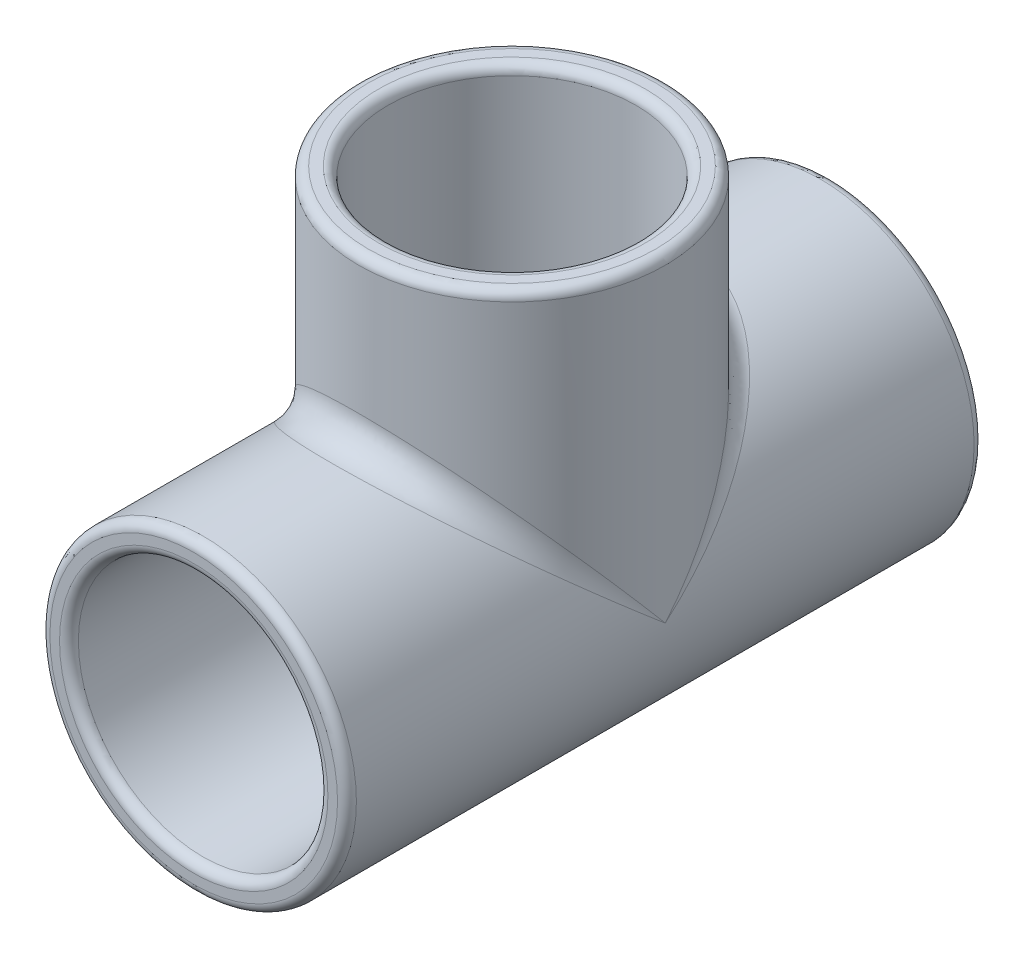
ISO-10303-21;
HEADER;
FILE_DESCRIPTION(('STEP AP214'),'2;1');
FILE_NAME('part.step','',(''),(''),'','','');
FILE_SCHEMA(('AUTOMOTIVE_DESIGN { 1 0 10303 214 1 1 1 1 }'));
ENDSEC;
DATA;
#1=APPLICATION_CONTEXT('core data for automotive mechanical design processes');
#2=APPLICATION_PROTOCOL_DEFINITION('international standard','automotive_design',2000,#1);
#3=PRODUCT_CONTEXT('',#1,'mechanical');
#4=PRODUCT('Part','Part','',(#3));
#5=PRODUCT_RELATED_PRODUCT_CATEGORY('part','',(#4));
#6=PRODUCT_DEFINITION_FORMATION('','',#4);
#7=PRODUCT_DEFINITION_CONTEXT('part definition',#1,'design');
#8=PRODUCT_DEFINITION('design','',#6,#7);
#9=PRODUCT_DEFINITION_SHAPE('','',#8);
#10=(LENGTH_UNIT() NAMED_UNIT(*) SI_UNIT(.MILLI.,.METRE.));
#11=(NAMED_UNIT(*) PLANE_ANGLE_UNIT() SI_UNIT($,.RADIAN.));
#12=(NAMED_UNIT(*) SI_UNIT($,.STERADIAN.) SOLID_ANGLE_UNIT());
#13=UNCERTAINTY_MEASURE_WITH_UNIT(LENGTH_MEASURE(1.E-05),#10,'distance_accuracy_value','');
#14=(GEOMETRIC_REPRESENTATION_CONTEXT(3) GLOBAL_UNCERTAINTY_ASSIGNED_CONTEXT((#13)) GLOBAL_UNIT_ASSIGNED_CONTEXT((#10,
#11,#12)) REPRESENTATION_CONTEXT('',''));
#15=CARTESIAN_POINT('',(0.,0.,0.));
#16=DIRECTION('',(0.,0.,1.));
#17=DIRECTION('',(1.,0.,0.));
#18=AXIS2_PLACEMENT_3D('',#15,#16,#17);
#19=CARTESIAN_POINT('',(0.,0.,85.725));
#20=DIRECTION('',(0.,0.,-1.));
#21=DIRECTION('',(-1.,0.,0.));
#22=AXIS2_PLACEMENT_3D('',#19,#20,#21);
#23=CYLINDRICAL_SURFACE('',#22,20.6375);
#24=CARTESIAN_POINT('',(0.,0.,84.455));
#25=DIRECTION('',(0.,0.,1.));
#26=DIRECTION('',(1.,0.,0.));
#27=AXIS2_PLACEMENT_3D('',#24,#25,#26);
#28=CIRCLE('',#27,20.6375);
#29=CARTESIAN_POINT('',(20.6375,0.,84.455));
#30=VERTEX_POINT('',#29);
#31=EDGE_CURVE('E261',#30,#30,#28,.F.);
#32=ORIENTED_EDGE('',*,*,#31,.T.);
#33=EDGE_LOOP('',(#32));
#34=FACE_BOUND('',#33,.T.);
#35=CARTESIAN_POINT('',(0.,0.,1.26999999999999));
#36=DIRECTION('',(0.,0.,1.));
#37=DIRECTION('',(1.,0.,0.));
#38=AXIS2_PLACEMENT_3D('',#35,#36,#37);
#39=CIRCLE('',#38,20.6375);
#40=CARTESIAN_POINT('',(20.6375,0.,1.26999999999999));
#41=VERTEX_POINT('',#40);
#42=EDGE_CURVE('E264',#41,#41,#39,.T.);
#43=ORIENTED_EDGE('',*,*,#42,.T.);
#44=EDGE_LOOP('',(#43));
#45=FACE_BOUND('',#44,.T.);
#46=CARTESIAN_POINT('',(-20.6375,0.,55.5625));
#47=CARTESIAN_POINT('',(-20.6374984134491,-0.323637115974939,55.5624984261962));
#48=CARTESIAN_POINT('',(-20.6298692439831,-0.647314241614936,55.5501115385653));
#49=CARTESIAN_POINT('',(-20.5995363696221,-1.29220575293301,55.500730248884));
#50=CARTESIAN_POINT('',(-20.5768252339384,-1.6134188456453,55.4637237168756));
#51=CARTESIAN_POINT('',(-20.5168374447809,-2.25135967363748,55.365528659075));
#52=CARTESIAN_POINT('',(-20.4795335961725,-2.56807788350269,55.3042949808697));
#53=CARTESIAN_POINT('',(-20.3912755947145,-3.19409020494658,55.1584781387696));
#54=CARTESIAN_POINT('',(-20.3403229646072,-3.50338514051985,55.0738975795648));
#55=CARTESIAN_POINT('',(-20.2262352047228,-4.11107383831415,54.8829000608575));
#56=CARTESIAN_POINT('',(-20.1631621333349,-4.40951429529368,54.7765941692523));
#57=CARTESIAN_POINT('',(-20.0260418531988,-4.99545821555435,54.5430342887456));
#58=CARTESIAN_POINT('',(-19.9519943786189,-5.28296141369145,54.4157797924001));
#59=CARTESIAN_POINT('',(-19.7944803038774,-5.84553243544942,54.1415793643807));
#60=CARTESIAN_POINT('',(-19.7110181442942,-6.12060603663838,53.9946427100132));
#61=CARTESIAN_POINT('',(-19.536230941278,-6.65746362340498,53.6821439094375));
#62=CARTESIAN_POINT('',(-19.4449029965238,-6.91924264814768,53.5165748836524));
#63=CARTESIAN_POINT('',(-19.2486892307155,-7.44849891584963,53.1542740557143));
#64=CARTESIAN_POINT('',(-19.1433018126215,-7.71481442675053,52.9561168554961));
#65=CARTESIAN_POINT('',(-18.9275576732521,-8.22994279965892,52.5406993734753));
#66=CARTESIAN_POINT('',(-18.8172007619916,-8.47875499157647,52.3234383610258));
#67=CARTESIAN_POINT('',(-18.5936286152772,-8.95843143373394,51.8705770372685));
#68=CARTESIAN_POINT('',(-18.4804096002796,-9.18927011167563,51.6349515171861));
#69=CARTESIAN_POINT('',(-18.2536722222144,-9.63180471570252,51.1466349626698));
#70=CARTESIAN_POINT('',(-18.1401539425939,-9.84350549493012,50.8939482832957));
#71=CARTESIAN_POINT('',(-17.9005748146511,-10.273462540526,50.3381293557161));
#72=CARTESIAN_POINT('',(-17.7748150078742,-10.4889558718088,50.0327214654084));
#73=CARTESIAN_POINT('',(-17.5299335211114,-10.893288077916,49.4021160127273));
#74=CARTESIAN_POINT('',(-17.4108130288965,-11.08212219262,49.0769149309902));
#75=CARTESIAN_POINT('',(-17.1835772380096,-11.4312913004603,48.4084512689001));
#76=CARTESIAN_POINT('',(-17.0754473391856,-11.5916643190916,48.0652135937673));
#77=CARTESIAN_POINT('',(-16.8744845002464,-11.8823160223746,47.3619638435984));
#78=CARTESIAN_POINT('',(-16.7816454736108,-12.0126066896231,47.0019585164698));
#79=CARTESIAN_POINT('',(-16.6366825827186,-12.2122204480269,46.3602629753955));
#80=CARTESIAN_POINT('',(-16.5801969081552,-12.2886312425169,46.0817457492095));
#81=CARTESIAN_POINT('',(-16.4800228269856,-12.4226515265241,45.5179886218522));
#82=CARTESIAN_POINT('',(-16.436331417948,-12.4802654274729,45.2327503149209));
#83=CARTESIAN_POINT('',(-16.3632873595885,-12.5758841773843,44.6575068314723));
#84=CARTESIAN_POINT('',(-16.3339187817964,-12.6139108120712,44.3675073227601));
#85=CARTESIAN_POINT('',(-16.2905440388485,-12.6698794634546,43.7844144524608));
#86=CARTESIAN_POINT('',(-16.2765381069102,-12.6878211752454,43.4913210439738));
#87=CARTESIAN_POINT('',(-16.2644264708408,-12.7033436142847,42.9035678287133));
#88=CARTESIAN_POINT('',(-16.2663584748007,-12.7008760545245,42.6089059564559));
#89=CARTESIAN_POINT('',(-16.2861351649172,-12.6755063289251,42.0210063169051));
#90=CARTESIAN_POINT('',(-16.3039799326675,-12.6526040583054,41.7277685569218));
#91=CARTESIAN_POINT('',(-16.3549007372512,-12.5867132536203,41.1447129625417));
#92=CARTESIAN_POINT('',(-16.3879870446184,-12.5437111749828,40.8548975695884));
#93=CARTESIAN_POINT('',(-16.4681714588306,-12.438251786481,40.2808185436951));
#94=CARTESIAN_POINT('',(-16.5152698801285,-12.3757940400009,39.9965550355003));
#95=CARTESIAN_POINT('',(-16.620859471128,-12.2336057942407,39.4405621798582));
#96=CARTESIAN_POINT('',(-16.6791153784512,-12.1542287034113,39.1686970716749));
#97=CARTESIAN_POINT('',(-16.8058836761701,-11.9783315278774,38.6329490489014));
#98=CARTESIAN_POINT('',(-16.8743994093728,-11.8818058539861,38.369068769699));
#99=CARTESIAN_POINT('',(-17.019893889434,-11.6724401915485,37.8502753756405));
#100=CARTESIAN_POINT('',(-17.0968730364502,-11.5595994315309,37.5953626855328));
#101=CARTESIAN_POINT('',(-17.2575208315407,-11.3183647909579,37.0952024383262));
#102=CARTESIAN_POINT('',(-17.3411898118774,-11.1899701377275,36.8499553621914));
#103=CARTESIAN_POINT('',(-17.5292402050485,-10.8934986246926,36.3258238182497));
#104=CARTESIAN_POINT('',(-17.6346147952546,-10.7224562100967,36.048969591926));
#105=CARTESIAN_POINT('',(-17.8496291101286,-10.3605715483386,35.5103697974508));
#106=CARTESIAN_POINT('',(-17.9592682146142,-10.1697321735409,35.2486220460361));
#107=CARTESIAN_POINT('',(-18.1804451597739,-9.76884205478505,34.7406460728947));
#108=CARTESIAN_POINT('',(-18.2919848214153,-9.5587719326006,34.4944339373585));
#109=CARTESIAN_POINT('',(-18.5144986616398,-9.12031794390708,34.0186050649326));
#110=CARTESIAN_POINT('',(-18.6254728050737,-8.89193295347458,33.7889893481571));
#111=CARTESIAN_POINT('',(-18.8616086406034,-8.38076169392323,33.3129996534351));
#112=CARTESIAN_POINT('',(-18.9863036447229,-8.09502985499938,33.069543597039));
#113=CARTESIAN_POINT('',(-19.2286559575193,-7.50120326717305,32.6075759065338));
#114=CARTESIAN_POINT('',(-19.3463124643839,-7.1931059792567,32.389067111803));
#115=CARTESIAN_POINT('',(-19.5713725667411,-6.55605460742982,31.9789531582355));
#116=CARTESIAN_POINT('',(-19.6787791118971,-6.22710656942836,31.787340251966));
#117=CARTESIAN_POINT('',(-19.8803281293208,-5.55010274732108,31.4330526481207));
#118=CARTESIAN_POINT('',(-19.9744722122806,-5.2020492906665,31.2703744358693));
#119=CARTESIAN_POINT('',(-20.1416799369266,-4.50982034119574,30.9846428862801));
#120=CARTESIAN_POINT('',(-20.2156483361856,-4.16658645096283,30.8598410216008));
#121=CARTESIAN_POINT('',(-20.3471775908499,-3.46772935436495,30.639610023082));
#122=CARTESIAN_POINT('',(-20.4047388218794,-3.11210643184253,30.5441802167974));
#123=CARTESIAN_POINT('',(-20.5016335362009,-2.39192170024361,30.3843346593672));
#124=CARTESIAN_POINT('',(-20.5409871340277,-2.02737022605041,30.3198846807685));
#125=CARTESIAN_POINT('',(-20.6002833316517,-1.29249264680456,30.2230083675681));
#126=CARTESIAN_POINT('',(-20.6202290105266,-0.922167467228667,30.1905769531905));
#127=CARTESIAN_POINT('',(-20.6386370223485,-0.233002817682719,30.1606489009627));
#128=CARTESIAN_POINT('',(-20.6397752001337,0.0855860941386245,30.1588009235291));
#129=CARTESIAN_POINT('',(-20.6273294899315,0.721690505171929,30.1790309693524));
#130=CARTESIAN_POINT('',(-20.6137473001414,1.03920612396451,30.2011062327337));
#131=CARTESIAN_POINT('',(-20.5721956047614,1.67072598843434,30.268869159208));
#132=CARTESIAN_POINT('',(-20.54422680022,1.98473040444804,30.3145556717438));
#133=CARTESIAN_POINT('',(-20.4745726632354,2.60697032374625,30.42892547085));
#134=CARTESIAN_POINT('',(-20.4328870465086,2.91520570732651,30.4976092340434));
#135=CARTESIAN_POINT('',(-20.3383629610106,3.51370565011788,30.6544542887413));
#136=CARTESIAN_POINT('',(-20.2859416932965,3.80422691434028,30.7418915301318));
#137=CARTESIAN_POINT('',(-20.1702589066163,4.37632673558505,30.9365174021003));
#138=CARTESIAN_POINT('',(-20.1069977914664,4.65790562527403,31.0437052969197));
#139=CARTESIAN_POINT('',(-19.9708677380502,5.21074775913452,31.2768147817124));
#140=CARTESIAN_POINT('',(-19.8979996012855,5.48201186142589,31.4027348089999));
#141=CARTESIAN_POINT('',(-19.7439629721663,6.01322316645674,31.6723298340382));
#142=CARTESIAN_POINT('',(-19.6627914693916,6.27316621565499,31.8160112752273));
#143=CARTESIAN_POINT('',(-19.484952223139,6.80660940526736,32.1356017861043));
#144=CARTESIAN_POINT('',(-19.3875482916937,7.0787908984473,32.3133029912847));
#145=CARTESIAN_POINT('',(-19.1863294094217,7.60731083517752,32.6878359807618));
#146=CARTESIAN_POINT('',(-19.082511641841,7.86364221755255,32.884676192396));
#147=CARTESIAN_POINT('',(-18.8704526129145,8.35973996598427,33.296478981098));
#148=CARTESIAN_POINT('',(-18.7622077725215,8.59949249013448,33.5114563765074));
#149=CARTESIAN_POINT('',(-18.5434904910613,9.06149564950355,33.9584211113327));
#150=CARTESIAN_POINT('',(-18.4330178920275,9.28374503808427,34.1904096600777));
#151=CARTESIAN_POINT('',(-18.1966044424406,9.73985906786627,34.7041268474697));
#152=CARTESIAN_POINT('',(-18.0706599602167,9.97100469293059,34.9882754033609));
#153=CARTESIAN_POINT('',(-17.8222081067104,10.4085842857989,35.5765018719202));
#154=CARTESIAN_POINT('',(-17.6997013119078,10.6150141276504,35.8805830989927));
#155=CARTESIAN_POINT('',(-17.4619878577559,11.0016747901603,36.507297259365));
#156=CARTESIAN_POINT('',(-17.3467748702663,11.1819285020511,36.8299136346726));
#157=CARTESIAN_POINT('',(-17.1275188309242,11.5149589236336,37.4928365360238));
#158=CARTESIAN_POINT('',(-17.0234779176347,11.6677303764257,37.8331464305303));
#159=CARTESIAN_POINT('',(-16.8513961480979,11.9144623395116,38.4554051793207));
#160=CARTESIAN_POINT('',(-16.7804089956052,12.014017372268,38.7343299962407));
#161=CARTESIAN_POINT('',(-16.6501097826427,12.1939573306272,39.3008090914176));
#162=CARTESIAN_POINT('',(-16.5907906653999,12.2743538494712,39.5883580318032));
#163=CARTESIAN_POINT('',(-16.4857975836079,12.4150150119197,40.1704819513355));
#164=CARTESIAN_POINT('',(-16.4401094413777,12.4753005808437,40.4650492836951));
#165=CARTESIAN_POINT('',(-16.3639758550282,12.5750010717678,41.0596665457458));
#166=CARTESIAN_POINT('',(-16.3335304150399,12.6144159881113,41.3597164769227));
#167=CARTESIAN_POINT('',(-16.2889910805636,12.6718790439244,41.9645990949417));
#168=CARTESIAN_POINT('',(-16.2749795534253,12.6898195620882,42.2694481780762));
#169=CARTESIAN_POINT('',(-16.2641804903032,12.7036577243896,42.8799553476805));
#170=CARTESIAN_POINT('',(-16.2673929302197,12.6995553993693,43.1856134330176));
#171=CARTESIAN_POINT('',(-16.2909073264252,12.6693765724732,43.7952888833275));
#172=CARTESIAN_POINT('',(-16.3112158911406,12.6432915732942,44.0993055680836));
#173=CARTESIAN_POINT('',(-16.3680804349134,12.5695864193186,44.703158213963));
#174=CARTESIAN_POINT('',(-16.4046363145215,12.5219663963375,45.0029942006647));
#175=CARTESIAN_POINT('',(-16.4895669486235,12.4098816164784,45.5762175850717));
#176=CARTESIAN_POINT('',(-16.5369710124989,12.3467796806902,45.8500187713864));
#177=CARTESIAN_POINT('',(-16.6431763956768,12.2032395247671,46.3908508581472));
#178=CARTESIAN_POINT('',(-16.7019813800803,12.1227957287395,46.6578795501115));
#179=CARTESIAN_POINT('',(-16.8293405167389,11.9453590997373,47.1840116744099));
#180=CARTESIAN_POINT('',(-16.8978954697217,11.8483649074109,47.4431144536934));
#181=CARTESIAN_POINT('',(-17.043021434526,11.6386481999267,47.9524706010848));
#182=CARTESIAN_POINT('',(-17.1195927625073,11.5259250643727,48.2027236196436));
#183=CARTESIAN_POINT('',(-17.3826008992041,11.1292925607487,49.01255976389));
#184=CARTESIAN_POINT('',(-17.5827369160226,10.8129612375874,49.5524146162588));
#185=CARTESIAN_POINT('',(-17.8934215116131,10.2846442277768,50.3199082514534));
#186=CARTESIAN_POINT('',(-17.9988069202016,10.0994206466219,50.5688500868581));
#187=CARTESIAN_POINT('',(-18.2110233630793,9.71153127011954,51.0522558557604));
#188=CARTESIAN_POINT('',(-18.3178544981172,9.50886425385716,51.2867187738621));
#189=CARTESIAN_POINT('',(-18.5505702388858,9.04771934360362,51.7823436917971));
#190=CARTESIAN_POINT('',(-18.6763235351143,8.78585262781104,52.0404208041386));
#191=CARTESIAN_POINT('',(-18.9236669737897,8.23960885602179,52.5338142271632));
#192=CARTESIAN_POINT('',(-19.0452565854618,7.95522894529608,52.76912764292));
#193=CARTESIAN_POINT('',(-19.2812424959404,7.36485895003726,53.2155590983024));
#194=CARTESIAN_POINT('',(-19.3956343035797,7.05885562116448,53.426662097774));
#195=CARTESIAN_POINT('',(-19.559461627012,6.58497046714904,53.7235737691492));
#196=CARTESIAN_POINT('',(-19.6127766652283,6.42453100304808,53.8192526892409));
#197=CARTESIAN_POINT('',(-19.7164956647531,6.09880573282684,54.0038476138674));
#198=CARTESIAN_POINT('',(-19.766898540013,5.93351815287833,54.0927610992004));
#199=CARTESIAN_POINT('',(-19.9120362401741,5.4347143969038,54.3469250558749));
#200=CARTESIAN_POINT('',(-20.0020097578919,5.09450385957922,54.5019534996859));
#201=CARTESIAN_POINT('',(-20.1664920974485,4.39849796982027,54.7823953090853));
#202=CARTESIAN_POINT('',(-20.2410036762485,4.0427054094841,54.9078139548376));
#203=CARTESIAN_POINT('',(-20.3393633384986,3.50006264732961,55.0721350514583));
#204=CARTESIAN_POINT('',(-20.3698844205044,3.31793077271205,55.1228906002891));
#205=CARTESIAN_POINT('',(-20.4262749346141,2.95096122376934,55.2163531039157));
#206=CARTESIAN_POINT('',(-20.4521455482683,2.76612424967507,55.2590621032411));
#207=CARTESIAN_POINT('',(-20.5224201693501,2.20834580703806,55.3747802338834));
#208=CARTESIAN_POINT('',(-20.5595512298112,1.83178555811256,55.4354871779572));
#209=CARTESIAN_POINT('',(-20.6032976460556,1.21198889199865,55.506862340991));
#210=CARTESIAN_POINT('',(-20.6161048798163,0.970274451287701,55.5277077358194));
#211=CARTESIAN_POINT('',(-20.6332068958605,0.48571422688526,55.5555275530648));
#212=CARTESIAN_POINT('',(-20.6375011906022,0.242868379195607,55.5625011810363));
#213=CARTESIAN_POINT('',(-20.6375,0.,55.5625));
#214=B_SPLINE_CURVE_WITH_KNOTS('',3,(#46,#47,#48,#49,#50,#51,#52,#53,#54,#55,#56,#57,#58,#59,
#60,#61,#62,#63,#64,#65,#66,#67,#68,#69,#70,#71,#72,#73,#74,#75,#76,#77,#78,#79,#80,#81,#82,#83,
#84,#85,#86,#87,#88,#89,#90,#91,#92,#93,#94,#95,#96,#97,#98,#99,#100,#101,#102,#103,#104,#105,
#106,#107,#108,#109,#110,#111,#112,#113,#114,#115,#116,#117,#118,#119,#120,#121,#122,#123,#124,
#125,#126,#127,#128,#129,#130,#131,#132,#133,#134,#135,#136,#137,#138,#139,#140,#141,#142,#143,
#144,#145,#146,#147,#148,#149,#150,#151,#152,#153,#154,#155,#156,#157,#158,#159,#160,#161,#162,
#163,#164,#165,#166,#167,#168,#169,#170,#171,#172,#173,#174,#175,#176,#177,#178,#179,#180,#181,
#182,#183,#184,#185,#186,#187,#188,#189,#190,#191,#192,#193,#194,#195,#196,#197,#198,#199,#200,
#201,#202,#203,#204,#205,#206,#207,#208,#209,#210,#211,#212,#213),.UNSPECIFIED.,.T.,.F.,(4,2,2,
2,2,2,2,2,2,2,2,2,2,2,2,2,2,2,2,2,2,2,2,2,2,2,2,2,2,2,2,2,2,2,2,2,2,2,2,2,2,2,2,2,2,2,2,2,2,2,2,
2,2,2,2,2,2,2,2,2,2,2,2,2,2,2,2,2,2,2,2,2,2,2,2,2,2,2,2,2,2,2,2,4),(0.,0.970656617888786,
1.94179182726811,2.91474554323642,3.88759075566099,4.85558154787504,5.82359579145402,
6.79115535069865,7.75907333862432,8.8028605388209,9.84668767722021,10.8919737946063,
11.9369940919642,13.1186705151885,14.3005576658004,15.4808536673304,16.6606787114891,
17.5426553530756,18.4244248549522,19.3052114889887,20.1860114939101,21.0688960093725,
21.9517850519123,22.8352699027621,23.7187745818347,24.5853722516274,25.4522528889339,
26.3191745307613,27.1861392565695,28.2113375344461,29.236387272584,30.2624815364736,
31.2886388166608,32.4738303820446,33.6591567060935,34.8441408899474,36.0289810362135,
37.1452410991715,38.2614756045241,39.3764740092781,40.4912954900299,41.4458774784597,
42.400349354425,43.3547747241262,44.3092198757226,45.2319103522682,46.154566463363,
47.0771456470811,48.0000605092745,49.0170430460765,50.034475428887,51.0527472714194,
52.0710915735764,53.2317838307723,54.3926695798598,55.5525339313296,56.7126199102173,
57.6254011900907,58.5376287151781,59.4489040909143,60.360179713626,61.2760034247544,
62.1918258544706,63.108002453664,64.0241734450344,64.8781554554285,65.7324124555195,
66.5867396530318,67.4411005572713,69.403445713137,70.3859888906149,71.3686008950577,
72.5329916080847,73.6975302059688,74.8627883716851,75.4454016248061,76.0282307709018,
77.1800813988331,78.3317264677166,78.9060649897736,79.480257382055,80.6275291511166,
81.3559014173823,82.0843153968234),.UNSPECIFIED.);
#215=CARTESIAN_POINT('',(-18.9418821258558,8.19216136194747,52.5670603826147));
#216=VERTEX_POINT('',#215);
#217=CARTESIAN_POINT('',(-18.9418821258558,8.19216136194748,33.1579396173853));
#218=VERTEX_POINT('',#217);
#219=EDGE_CURVE('E89',#216,#218,#214,.T.);
#220=ORIENTED_EDGE('',*,*,#219,.T.);
#221=CARTESIAN_POINT('',(0.,0.,42.8625));
#222=DIRECTION('',(0.,0.764138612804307,0.645052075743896));
#223=DIRECTION('',(0.,-0.645052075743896,0.764138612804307));
#224=AXIS2_PLACEMENT_3D('',#221,#222,#223);
#225=ELLIPSE('',#224,31.993540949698,20.6375);
#226=CARTESIAN_POINT('',(20.6375,0.,42.8625));
#227=VERTEX_POINT('',#226);
#228=EDGE_CURVE('E91',#218,#227,#225,.F.);
#229=ORIENTED_EDGE('',*,*,#228,.T.);
#230=CARTESIAN_POINT('',(0.,0.,42.8625));
#231=DIRECTION('',(0.,0.764138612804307,-0.645052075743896));
#232=DIRECTION('',(0.,-0.645052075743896,-0.764138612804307));
#233=AXIS2_PLACEMENT_3D('',#230,#231,#232);
#234=ELLIPSE('',#233,31.993540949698,20.6375);
#235=EDGE_CURVE('E93',#227,#216,#234,.F.);
#236=ORIENTED_EDGE('',*,*,#235,.T.);
#237=EDGE_LOOP('',(#220,#229,#236));
#238=FACE_BOUND('',#237,.T.);
#239=ADVANCED_FACE('F44',(#34,#45,#238),#23,.T.);
#240=CARTESIAN_POINT('',(0.,42.9895,42.8625));
#241=DIRECTION('',(0.,-1.,0.));
#242=DIRECTION('',(0.,0.,-1.));
#243=AXIS2_PLACEMENT_3D('',#240,#241,#242);
#244=CYLINDRICAL_SURFACE('',#243,13.8200475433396);
#245=CARTESIAN_POINT('',(-6.61661349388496,3.75178091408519,30.7293165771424));
#246=CARTESIAN_POINT('',(-6.68103190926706,3.8653685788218,30.7644430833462));
#247=CARTESIAN_POINT('',(-6.74674249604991,3.97777758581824,30.8009458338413));
#248=CARTESIAN_POINT('',(-6.88032083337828,4.20036392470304,30.8766426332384));
#249=CARTESIAN_POINT('',(-6.94818826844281,4.31054157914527,30.9158362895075));
#250=CARTESIAN_POINT('',(-7.15433037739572,4.63783212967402,31.0373284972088));
#251=CARTESIAN_POINT('',(-7.29522427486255,4.85184051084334,31.1235811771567));
#252=CARTESIAN_POINT('',(-7.58140542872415,5.27235105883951,31.3063389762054));
#253=CARTESIAN_POINT('',(-7.72669254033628,5.47885347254,31.4028437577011));
#254=CARTESIAN_POINT('',(-8.01979726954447,5.88499644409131,31.6060184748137));
#255=CARTESIAN_POINT('',(-8.16761529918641,6.08463586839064,31.7126900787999));
#256=CARTESIAN_POINT('',(-8.46564400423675,6.47921943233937,31.9372211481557));
#257=CARTESIAN_POINT('',(-8.61586413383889,6.67410234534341,32.0551757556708));
#258=CARTESIAN_POINT('',(-8.91604147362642,7.05735270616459,32.3014564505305));
#259=CARTESIAN_POINT('',(-9.0659986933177,7.24572039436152,32.4297821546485));
#260=CARTESIAN_POINT('',(-9.51377752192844,7.80105667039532,32.8304510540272));
#261=CARTESIAN_POINT('',(-9.8096548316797,8.15845202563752,33.1185960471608));
#262=CARTESIAN_POINT('',(-10.3095546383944,8.75220929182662,33.6536894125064));
#263=CARTESIAN_POINT('',(-10.5167020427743,8.99508323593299,33.8905763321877));
#264=CARTESIAN_POINT('',(-10.9211646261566,9.46479950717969,34.3875692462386));
#265=CARTESIAN_POINT('',(-11.1184811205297,9.69164398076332,34.6476721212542));
#266=CARTESIAN_POINT('',(-11.499611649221,10.1266118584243,35.1903288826));
#267=CARTESIAN_POINT('',(-11.6834720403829,10.3348001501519,35.4727979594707));
#268=CARTESIAN_POINT('',(-12.0353240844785,10.7309643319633,36.0608819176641));
#269=CARTESIAN_POINT('',(-12.2033195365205,10.9189450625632,36.3664912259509));
#270=CARTESIAN_POINT('',(-12.4829749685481,11.2305158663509,36.9259473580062));
#271=CARTESIAN_POINT('',(-12.5986152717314,11.3588766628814,37.1751586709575));
#272=CARTESIAN_POINT('',(-12.8170234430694,11.6006493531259,37.6861327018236));
#273=CARTESIAN_POINT('',(-12.9197943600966,11.7140647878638,37.94789242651));
#274=CARTESIAN_POINT('',(-13.110877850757,11.9244850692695,38.4830793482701));
#275=CARTESIAN_POINT('',(-13.1991898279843,12.0214892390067,38.7565070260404));
#276=CARTESIAN_POINT('',(-13.3597793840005,12.197593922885,39.3136898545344));
#277=CARTESIAN_POINT('',(-13.4320566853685,12.2766941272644,39.5974451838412));
#278=CARTESIAN_POINT('',(-13.5596146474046,12.4161280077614,40.1757030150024));
#279=CARTESIAN_POINT('',(-13.614761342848,12.4763138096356,40.470271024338));
#280=CARTESIAN_POINT('',(-13.7060719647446,12.5758932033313,41.0658241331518));
#281=CARTESIAN_POINT('',(-13.74223586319,12.6152867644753,41.3668092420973));
#282=CARTESIAN_POINT('',(-13.7946995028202,12.6724168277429,41.9723896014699));
#283=CARTESIAN_POINT('',(-13.8110100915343,12.6901651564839,42.2769827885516));
#284=CARTESIAN_POINT('',(-13.823391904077,12.7036395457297,42.8870513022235));
#285=CARTESIAN_POINT('',(-13.8194652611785,12.6993679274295,43.1925265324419));
#286=CARTESIAN_POINT('',(-13.7931705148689,12.6707483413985,43.7647616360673));
#287=CARTESIAN_POINT('',(-13.7730785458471,12.6488782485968,44.0317566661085));
#288=CARTESIAN_POINT('',(-13.7177136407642,12.588570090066,44.562250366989));
#289=CARTESIAN_POINT('',(-13.682442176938,12.5501336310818,44.8257493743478));
#290=CARTESIAN_POINT('',(-13.5973599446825,12.4573202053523,45.3475371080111));
#291=CARTESIAN_POINT('',(-13.547548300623,12.4029422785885,45.6058255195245));
#292=CARTESIAN_POINT('',(-13.4342375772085,12.2790736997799,46.1156807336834));
#293=CARTESIAN_POINT('',(-13.3707377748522,12.209582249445,46.3672471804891));
#294=CARTESIAN_POINT('',(-13.2295973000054,12.0548561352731,46.8675503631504));
#295=CARTESIAN_POINT('',(-13.15169009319,11.9693242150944,47.1161195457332));
#296=CARTESIAN_POINT('',(-12.9837779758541,11.7845772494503,47.6039994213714));
#297=CARTESIAN_POINT('',(-12.8937684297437,11.6853569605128,47.8433065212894));
#298=CARTESIAN_POINT('',(-12.7028665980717,11.4743681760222,48.3118004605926));
#299=CARTESIAN_POINT('',(-12.6019746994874,11.3626001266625,48.5409876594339));
#300=CARTESIAN_POINT('',(-12.390478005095,11.127571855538,48.9887641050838));
#301=CARTESIAN_POINT('',(-12.2798711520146,11.0043091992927,49.20735109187));
#302=CARTESIAN_POINT('',(-11.9923028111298,10.6826552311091,49.740780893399));
#303=CARTESIAN_POINT('',(-11.8099405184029,10.477651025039,50.0487605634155));
#304=CARTESIAN_POINT('',(-11.4295385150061,10.0469325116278,50.6395769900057));
#305=CARTESIAN_POINT('',(-11.2314920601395,9.8212092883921,50.9224028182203));
#306=CARTESIAN_POINT('',(-10.8226322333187,9.35089393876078,51.4636433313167));
#307=CARTESIAN_POINT('',(-10.6117855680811,9.1062521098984,51.7219894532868));
#308=CARTESIAN_POINT('',(-10.1811239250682,8.60053271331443,52.2137153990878));
#309=CARTESIAN_POINT('',(-9.96131037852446,8.33945776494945,52.4470991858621));
#310=CARTESIAN_POINT('',(-9.51046692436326,7.79545069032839,52.8948527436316));
#311=CARTESIAN_POINT('',(-9.27929417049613,7.51214000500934,53.1086173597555));
#312=CARTESIAN_POINT('',(-8.81455882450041,6.9299048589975,53.5110551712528));
#313=CARTESIAN_POINT('',(-8.58099549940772,6.63097548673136,53.6997204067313));
#314=CARTESIAN_POINT('',(-8.11683141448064,6.01823663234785,54.0515692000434));
#315=CARTESIAN_POINT('',(-7.88622329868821,5.70448099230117,54.2148369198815));
#316=CARTESIAN_POINT('',(-7.43318321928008,5.05978206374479,54.5164804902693));
#317=CARTESIAN_POINT('',(-7.21074473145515,4.72885302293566,54.6548765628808));
#318=CARTESIAN_POINT('',(-6.93169436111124,4.28382179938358,54.8187164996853));
#319=CARTESIAN_POINT('',(-6.86725394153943,4.17883396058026,54.8558257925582));
#320=CARTESIAN_POINT('',(-6.740354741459,3.9668494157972,54.9275998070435));
#321=CARTESIAN_POINT('',(-6.67789591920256,3.85985275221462,54.9622645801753));
#322=CARTESIAN_POINT('',(-6.61661349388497,3.75178091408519,54.9956834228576));
#323=B_SPLINE_CURVE_WITH_KNOTS('',3,(#245,#246,#247,#248,#249,#250,#251,#252,#253,#254,#255,
#256,#257,#258,#259,#260,#261,#262,#263,#264,#265,#266,#267,#268,#269,#270,#271,#272,#273,#274,
#275,#276,#277,#278,#279,#280,#281,#282,#283,#284,#285,#286,#287,#288,#289,#290,#291,#292,#293,
#294,#295,#296,#297,#298,#299,#300,#301,#302,#303,#304,#305,#306,#307,#308,#309,#310,#311,#312,
#313,#314,#315,#316,#317,#318,#319,#320,#321,#322),.UNSPECIFIED.,.F.,.F.,(4,2,2,2,2,2,2,2,2,2,2,
2,2,2,2,2,2,2,2,2,2,2,2,2,2,2,2,2,2,2,2,2,2,2,2,2,2,2,4),(0.,0.405628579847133,
0.811198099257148,1.62184345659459,2.43246212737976,3.2432140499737,4.06153425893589,
4.87982424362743,6.51560408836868,7.70717720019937,8.89859044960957,10.0856845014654,
11.2724935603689,12.1814074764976,13.0901056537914,13.9988413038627,14.9075926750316,
15.8232814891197,16.7389716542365,17.6541612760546,18.5692544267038,19.3742241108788,
20.1791157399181,20.9840558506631,21.789038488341,22.6107561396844,23.4327894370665,
24.2547935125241,25.0769720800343,26.3125425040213,27.5486471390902,28.7881174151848,
30.0273906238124,31.2969943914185,32.5669998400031,33.8327027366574,35.0973718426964,
35.4832935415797,35.8692071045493),.UNSPECIFIED.);
#324=CARTESIAN_POINT('',(-10.8527549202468,9.38501866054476,34.3061325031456));
#325=VERTEX_POINT('',#324);
#326=CARTESIAN_POINT('',(-10.8527549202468,9.38501866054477,51.4188674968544));
#327=VERTEX_POINT('',#326);
#328=EDGE_CURVE('E65',#325,#327,#323,.T.);
#329=ORIENTED_EDGE('',*,*,#328,.F.);
#330=CARTESIAN_POINT('',(0.,14.3478522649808,29.0424524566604));
#331=CARTESIAN_POINT('',(-0.312319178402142,14.3478488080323,29.0424559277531));
#332=CARTESIAN_POINT('',(-0.62473009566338,14.3376307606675,29.0530634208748));
#333=CARTESIAN_POINT('',(-1.24694819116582,14.2969685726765,29.0952856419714));
#334=CARTESIAN_POINT('',(-1.55675353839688,14.2665112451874,29.1269140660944));
#335=CARTESIAN_POINT('',(-2.17174254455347,14.1859363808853,29.2106221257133));
#336=CARTESIAN_POINT('',(-2.47691363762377,14.1357728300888,29.262749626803));
#337=CARTESIAN_POINT('',(-3.07951935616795,14.016838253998,29.3864141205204));
#338=CARTESIAN_POINT('',(-3.37695505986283,13.948069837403,29.4579483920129));
#339=CARTESIAN_POINT('',(-3.96009319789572,13.7937971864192,29.6185510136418));
#340=CARTESIAN_POINT('',(-4.2458652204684,13.7084182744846,29.7074880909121));
#341=CARTESIAN_POINT('',(-4.8064825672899,13.5220510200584,29.9018105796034));
#342=CARTESIAN_POINT('',(-5.08132776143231,13.4210624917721,30.0071961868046));
#343=CARTESIAN_POINT('',(-5.61891187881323,13.2050211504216,30.2329116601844));
#344=CARTESIAN_POINT('',(-5.88165562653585,13.0899740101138,30.3532354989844));
#345=CARTESIAN_POINT('',(-6.3944733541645,12.8472601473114,30.6074451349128));
#346=CARTESIAN_POINT('',(-6.64454438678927,12.7195905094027,30.7413340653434));
#347=CARTESIAN_POINT('',(-7.2311272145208,12.3985712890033,31.0785668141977));
#348=CARTESIAN_POINT('',(-7.56118582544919,12.1997072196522,31.287928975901));
#349=CARTESIAN_POINT('',(-8.19473446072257,11.7835042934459,31.7274732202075));
#350=CARTESIAN_POINT('',(-8.49821480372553,11.5661587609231,31.9576628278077));
#351=CARTESIAN_POINT('',(-9.0793964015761,11.1157953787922,32.4365509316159));
#352=CARTESIAN_POINT('',(-9.35702917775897,10.8827385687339,32.685295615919));
#353=CARTESIAN_POINT('',(-9.8860529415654,10.4045169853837,33.1983675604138));
#354=CARTESIAN_POINT('',(-10.1374454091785,10.1593528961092,33.4626939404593));
#355=CARTESIAN_POINT('',(-10.6960113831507,9.57448578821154,34.0975837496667));
#356=CARTESIAN_POINT('',(-10.9930084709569,9.23103130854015,34.4736598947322));
#357=CARTESIAN_POINT('',(-11.5428974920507,8.5334388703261,35.2479717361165));
#358=CARTESIAN_POINT('',(-11.7957600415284,8.17929397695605,35.6462219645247));
#359=CARTESIAN_POINT('',(-12.1426976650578,7.64596130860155,36.2592035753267));
#360=CARTESIAN_POINT('',(-12.2528907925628,7.46794551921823,36.4659948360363));
#361=CARTESIAN_POINT('',(-12.4627282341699,7.11223399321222,36.8851200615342));
#362=CARTESIAN_POINT('',(-12.5623735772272,6.93453822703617,37.0974534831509));
#363=CARTESIAN_POINT('',(-12.7511319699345,6.581004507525,37.5279387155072));
#364=CARTESIAN_POINT('',(-12.8402534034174,6.40516517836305,37.7460857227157));
#365=CARTESIAN_POINT('',(-13.0080562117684,6.05711184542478,38.189136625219));
#366=CARTESIAN_POINT('',(-13.0867399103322,5.8848970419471,38.4140390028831));
#367=CARTESIAN_POINT('',(-13.2094115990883,5.60246640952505,38.7966463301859));
#368=CARTESIAN_POINT('',(-13.256299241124,5.49048891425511,38.9521229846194));
#369=CARTESIAN_POINT('',(-13.3452353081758,5.27063640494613,39.2673313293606));
#370=CARTESIAN_POINT('',(-13.3872835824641,5.16276151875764,39.4270631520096));
#371=CARTESIAN_POINT('',(-13.4663687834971,4.95281128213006,39.7514713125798));
#372=CARTESIAN_POINT('',(-13.5034072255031,4.85073418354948,39.9161461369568));
#373=CARTESIAN_POINT('',(-13.5722055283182,4.65477225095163,40.2513318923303));
#374=CARTESIAN_POINT('',(-13.603966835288,4.56088517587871,40.4218412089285));
#375=CARTESIAN_POINT('',(-13.6727558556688,4.35118560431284,40.8355236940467));
#376=CARTESIAN_POINT('',(-13.7072399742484,4.24049009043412,41.0818124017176));
#377=CARTESIAN_POINT('',(-13.7635484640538,4.05404063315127,41.5885776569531));
#378=CARTESIAN_POINT('',(-13.7854122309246,3.97817810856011,41.849007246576));
#379=CARTESIAN_POINT('',(-13.811416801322,3.88684168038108,42.3291869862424));
#380=CARTESIAN_POINT('',(-13.8181726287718,3.86250877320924,42.5470298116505));
#381=CARTESIAN_POINT('',(-13.8212385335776,3.85153096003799,42.9835297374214));
#382=CARTESIAN_POINT('',(-13.8175602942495,3.86484390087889,43.2021856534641));
#383=CARTESIAN_POINT('',(-13.7981073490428,3.93376931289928,43.6857690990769));
#384=CARTESIAN_POINT('',(-13.7796423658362,3.99876334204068,43.949212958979));
#385=CARTESIAN_POINT('',(-13.74212557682,4.12513610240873,44.3337480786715));
#386=CARTESIAN_POINT('',(-13.7279292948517,4.17224833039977,44.4604975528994));
#387=CARTESIAN_POINT('',(-13.696515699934,4.27424651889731,44.7104672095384));
#388=CARTESIAN_POINT('',(-13.6792986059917,4.32913191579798,44.8336876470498));
#389=CARTESIAN_POINT('',(-13.6359078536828,4.46423748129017,45.1169522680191));
#390=CARTESIAN_POINT('',(-13.6086557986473,4.54683059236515,45.2756867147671));
#391=CARTESIAN_POINT('',(-13.5495785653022,4.71997925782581,45.5879086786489));
#392=CARTESIAN_POINT('',(-13.5177511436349,4.8105387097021,45.741393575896));
#393=CARTESIAN_POINT('',(-13.4157026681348,5.0910875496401,46.195556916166));
#394=CARTESIAN_POINT('',(-13.3389943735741,5.28969217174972,46.4894449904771));
#395=CARTESIAN_POINT('',(-13.1689495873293,5.69995614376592,47.0652270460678));
#396=CARTESIAN_POINT('',(-13.0755237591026,5.91168142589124,47.3470459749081));
#397=CARTESIAN_POINT('',(-12.8727173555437,6.34116483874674,47.8996996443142));
#398=CARTESIAN_POINT('',(-12.7633508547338,6.55891751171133,48.1705438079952));
#399=CARTESIAN_POINT('',(-12.5500540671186,6.95688892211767,48.6544219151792));
#400=CARTESIAN_POINT('',(-12.4487823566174,7.13669522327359,48.8689757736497));
#401=CARTESIAN_POINT('',(-12.2354390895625,7.49657748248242,49.2924251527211));
#402=CARTESIAN_POINT('',(-12.123366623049,7.6766534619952,49.5013201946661));
#403=CARTESIAN_POINT('',(-11.7705739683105,8.21576947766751,50.1201221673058));
#404=CARTESIAN_POINT('',(-11.5133706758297,8.57352278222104,50.5219368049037));
#405=CARTESIAN_POINT('',(-10.9547420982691,9.2766135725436,51.3014721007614));
#406=CARTESIAN_POINT('',(-10.6534962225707,9.62199466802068,51.6792819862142));
#407=CARTESIAN_POINT('',(-10.0044044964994,10.2951988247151,52.409432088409));
#408=CARTESIAN_POINT('',(-9.65659276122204,10.6230344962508,52.7617906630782));
#409=CARTESIAN_POINT('',(-9.04504011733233,11.1421291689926,53.3164796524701));
#410=CARTESIAN_POINT('',(-8.79531147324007,11.3405429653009,53.5276490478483));
#411=CARTESIAN_POINT('',(-8.27559366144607,11.7251817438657,53.9357744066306));
#412=CARTESIAN_POINT('',(-8.00560588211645,11.9114075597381,54.1327313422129));
#413=CARTESIAN_POINT('',(-7.44559791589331,12.2692408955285,54.5102781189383));
#414=CARTESIAN_POINT('',(-7.15559332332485,12.4408595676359,54.6908804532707));
#415=CARTESIAN_POINT('',(-6.55574597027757,12.7671279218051,55.0335785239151));
#416=CARTESIAN_POINT('',(-6.24590663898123,12.9217805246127,55.1956774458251));
#417=CARTESIAN_POINT('',(-5.66412970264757,13.1856585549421,55.4718532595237));
#418=CARTESIAN_POINT('',(-5.39525474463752,13.2980710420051,55.5893431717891));
#419=CARTESIAN_POINT('',(-4.84558561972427,13.5080597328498,55.8086006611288));
#420=CARTESIAN_POINT('',(-4.56479397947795,13.6056390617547,55.9103715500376));
#421=CARTESIAN_POINT('',(-3.99257810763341,13.7844109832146,56.0966801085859));
#422=CARTESIAN_POINT('',(-3.70115808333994,13.8656099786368,56.1812245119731));
#423=CARTESIAN_POINT('',(-3.10920704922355,14.0102287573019,56.3317164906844));
#424=CARTESIAN_POINT('',(-2.80867596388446,14.0736483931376,56.3976639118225));
#425=CARTESIAN_POINT('',(-2.19858037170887,14.1818085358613,56.5100924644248));
#426=CARTESIAN_POINT('',(-1.88896989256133,14.2264251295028,56.5564444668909));
#427=CARTESIAN_POINT('',(-1.265071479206,14.2954170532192,56.6281054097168));
#428=CARTESIAN_POINT('',(-0.950783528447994,14.3197923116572,56.6534142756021));
#429=CARTESIAN_POINT('',(-0.320377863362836,14.3477434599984,56.6824351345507));
#430=CARTESIAN_POINT('',(-0.00426071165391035,14.3513254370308,56.68615344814));
#431=CARTESIAN_POINT('',(0.627014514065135,14.3376207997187,56.6719251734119));
#432=CARTESIAN_POINT('',(0.942172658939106,14.3203357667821,56.6539802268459));
#433=CARTESIAN_POINT('',(1.53600068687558,14.2681791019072,56.5998152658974));
#434=CARTESIAN_POINT('',(1.81504579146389,14.2353312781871,56.5656981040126));
#435=CARTESIAN_POINT('',(2.36825024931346,14.1538126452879,56.4809945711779));
#436=CARTESIAN_POINT('',(2.64241001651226,14.1051431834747,56.430409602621));
#437=CARTESIAN_POINT('',(3.18424140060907,13.9927854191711,56.3135650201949));
#438=CARTESIAN_POINT('',(3.451912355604,13.9290955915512,56.2473038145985));
#439=CARTESIAN_POINT('',(3.97937483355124,13.787676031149,56.1000707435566));
#440=CARTESIAN_POINT('',(4.23916587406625,13.7099454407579,56.0190979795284));
#441=CARTESIAN_POINT('',(4.76302202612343,13.5371510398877,55.8389398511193));
#442=CARTESIAN_POINT('',(5.0266083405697,13.4413966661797,55.7390269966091));
#443=CARTESIAN_POINT('',(5.54294537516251,13.2368340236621,55.5253424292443));
#444=CARTESIAN_POINT('',(5.79569255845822,13.1280215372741,55.4115662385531));
#445=CARTESIAN_POINT('',(6.28961183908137,12.8986739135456,55.1714359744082));
#446=CARTESIAN_POINT('',(6.53078364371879,12.7781384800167,55.0450815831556));
#447=CARTESIAN_POINT('',(7.00113561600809,12.5266164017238,54.7809975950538));
#448=CARTESIAN_POINT('',(7.23031448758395,12.3956286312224,54.6432667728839));
#449=CARTESIAN_POINT('',(7.79923783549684,12.0497516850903,54.2789020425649));
#450=CARTESIAN_POINT('',(8.13044438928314,11.8283500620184,54.045044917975));
#451=CARTESIAN_POINT('',(8.763310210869,11.3674364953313,53.5563330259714));
#452=CARTESIAN_POINT('',(9.06496457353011,11.1279215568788,53.3014747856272));
#453=CARTESIAN_POINT('',(9.64008812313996,10.6336147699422,52.7728706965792));
#454=CARTESIAN_POINT('',(9.91346325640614,10.3787761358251,52.4990665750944));
#455=CARTESIAN_POINT('',(10.4315345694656,9.85793609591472,51.9357148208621));
#456=CARTESIAN_POINT('',(10.6762358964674,9.59193670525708,51.6461700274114));
#457=CARTESIAN_POINT('',(11.2037266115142,8.97472351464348,50.9682839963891));
#458=CARTESIAN_POINT('',(11.4774875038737,8.62083447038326,50.575309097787));
#459=CARTESIAN_POINT('',(11.8549906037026,8.08504391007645,49.9695058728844));
#460=CARTESIAN_POINT('',(11.9753668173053,7.90550706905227,49.7647148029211));
#461=CARTESIAN_POINT('',(12.2052070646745,7.54581343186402,49.34963555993));
#462=CARTESIAN_POINT('',(12.3146722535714,7.36565670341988,49.1393479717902));
#463=CARTESIAN_POINT('',(12.5227168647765,7.00610589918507,48.7132634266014));
#464=CARTESIAN_POINT('',(12.6213077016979,6.82671121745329,48.4974725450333));
#465=CARTESIAN_POINT('',(12.8078073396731,6.47003901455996,48.0596539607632));
#466=CARTESIAN_POINT('',(12.8957176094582,6.29276120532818,47.8376271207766));
#467=CARTESIAN_POINT('',(13.060739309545,5.94267106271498,47.3866992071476));
#468=CARTESIAN_POINT('',(13.1378660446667,5.76985269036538,47.1578084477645));
#469=CARTESIAN_POINT('',(13.2812865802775,5.43156834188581,46.6914288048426));
#470=CARTESIAN_POINT('',(13.3475852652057,5.26609907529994,46.4539438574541));
#471=CARTESIAN_POINT('',(13.4467739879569,5.00568662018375,46.0567460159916));
#472=CARTESIAN_POINT('',(13.4830235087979,4.90705286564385,45.9002982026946));
#473=CARTESIAN_POINT('',(13.5507827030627,4.71670836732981,45.5821472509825));
#474=CARTESIAN_POINT('',(13.5822911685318,4.62499939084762,45.4204427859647));
#475=CARTESIAN_POINT('',(13.6401020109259,4.45160615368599,45.0916405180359));
#476=CARTESIAN_POINT('',(13.6664254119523,4.36988194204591,44.9245678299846));
#477=CARTESIAN_POINT('',(13.7135069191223,4.21980745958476,44.5838383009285));
#478=CARTESIAN_POINT('',(13.7342694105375,4.15144666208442,44.4101867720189));
#479=CARTESIAN_POINT('',(13.7734286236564,4.01985695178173,44.0171975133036));
#480=CARTESIAN_POINT('',(13.7903181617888,3.96101003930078,43.7961652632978));
#481=CARTESIAN_POINT('',(13.8133643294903,3.87991914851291,43.3471332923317));
#482=CARTESIAN_POINT('',(13.8195484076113,3.85758156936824,43.1191529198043));
#483=CARTESIAN_POINT('',(13.8204896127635,3.85421178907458,42.6620179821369));
#484=CARTESIAN_POINT('',(13.8152055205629,3.87332858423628,42.4328621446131));
#485=CARTESIAN_POINT('',(13.7937801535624,3.94890687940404,41.9811199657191));
#486=CARTESIAN_POINT('',(13.7776115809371,4.00546226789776,41.7585516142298));
#487=CARTESIAN_POINT('',(13.7396037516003,4.13373354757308,41.3627575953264));
#488=CARTESIAN_POINT('',(13.7192994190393,4.20091801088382,41.1878357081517));
#489=CARTESIAN_POINT('',(13.6730388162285,4.3491267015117,40.8446499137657));
#490=CARTESIAN_POINT('',(13.647077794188,4.43016255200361,40.6763917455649));
#491=CARTESIAN_POINT('',(13.5899137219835,4.60254201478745,40.3452955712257));
#492=CARTESIAN_POINT('',(13.5586882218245,4.69392919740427,40.1824845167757));
#493=CARTESIAN_POINT('',(13.4914360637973,4.88386985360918,39.8622309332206));
#494=CARTESIAN_POINT('',(13.4554107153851,4.98242136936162,39.7047869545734));
#495=CARTESIAN_POINT('',(13.3612591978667,5.23090718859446,39.3234642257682));
#496=CARTESIAN_POINT('',(13.3005579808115,5.383736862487,39.1021151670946));
#497=CARTESIAN_POINT('',(13.1697898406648,5.69616136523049,38.667035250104));
#498=CARTESIAN_POINT('',(13.0997192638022,5.85575881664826,38.4533074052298));
#499=CARTESIAN_POINT('',(12.9502853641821,6.17922009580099,38.031989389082));
#500=CARTESIAN_POINT('',(12.8709105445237,6.34308900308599,37.8244072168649));
#501=CARTESIAN_POINT('',(12.7029610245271,6.67307600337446,37.4147952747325));
#502=CARTESIAN_POINT('',(12.6143851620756,6.83919437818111,37.2127662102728));
#503=CARTESIAN_POINT('',(12.4279258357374,7.17244786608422,36.8136220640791));
#504=CARTESIAN_POINT('',(12.3300356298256,7.33958363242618,36.6165106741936));
#505=CARTESIAN_POINT('',(12.1249082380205,7.67371643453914,36.2270850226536));
#506=CARTESIAN_POINT('',(12.0176702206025,7.84071345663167,36.0347711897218));
#507=CARTESIAN_POINT('',(11.6819318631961,8.33990196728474,35.4651695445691));
#508=CARTESIAN_POINT('',(11.4392177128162,8.67063418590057,35.0948155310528));
#509=CARTESIAN_POINT('',(10.9513425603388,9.27677857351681,34.4239643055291));
#510=CARTESIAN_POINT('',(10.7112448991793,9.55347242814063,34.1209286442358));
#511=CARTESIAN_POINT('',(10.201157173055,10.0963341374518,33.5307126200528));
#512=CARTESIAN_POINT('',(9.93116146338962,10.3624999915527,33.2435352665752));
#513=CARTESIAN_POINT('',(9.3612373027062,10.8800706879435,32.6880767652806));
#514=CARTESIAN_POINT('',(9.06138592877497,11.1315110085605,32.4197498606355));
#515=CARTESIAN_POINT('',(8.43052614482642,11.6165981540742,31.9041317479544));
#516=CARTESIAN_POINT('',(8.099516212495,11.8502441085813,31.6568415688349));
#517=CARTESIAN_POINT('',(7.50057695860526,12.2348768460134,31.2509527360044));
#518=CARTESIAN_POINT('',(7.23993596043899,12.3910772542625,31.0865085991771));
#519=CARTESIAN_POINT('',(6.70242795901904,12.6898706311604,30.7725042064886));
#520=CARTESIAN_POINT('',(6.42556523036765,12.8324671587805,30.622940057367));
#521=CARTESIAN_POINT('',(5.85620761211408,13.1020949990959,30.3405391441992));
#522=CARTESIAN_POINT('',(5.56371585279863,13.2291294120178,30.2076990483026));
#523=CARTESIAN_POINT('',(4.96408841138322,13.4656040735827,29.9606933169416));
#524=CARTESIAN_POINT('',(4.65695535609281,13.5750474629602,29.846524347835));
#525=CARTESIAN_POINT('',(4.07646899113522,13.7594209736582,29.6543535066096));
#526=CARTESIAN_POINT('',(3.80492026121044,13.8370644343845,29.5734967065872));
#527=CARTESIAN_POINT('',(3.25367514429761,13.9769552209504,29.4278978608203));
#528=CARTESIAN_POINT('',(2.97398027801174,14.0392054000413,29.363152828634));
#529=CARTESIAN_POINT('',(2.40866357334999,14.1471495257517,29.2509268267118));
#530=CARTESIAN_POINT('',(2.12305618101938,14.1928797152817,29.2034080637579));
#531=CARTESIAN_POINT('',(1.54732923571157,14.2671225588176,29.1262797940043));
#532=CARTESIAN_POINT('',(1.2572122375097,14.2956446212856,29.0966605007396));
#533=CARTESIAN_POINT('',(0.80543338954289,14.3261317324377,29.0650035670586));
#534=CARTESIAN_POINT('',(0.644592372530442,14.3342708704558,29.0565529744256));
#535=CARTESIAN_POINT('',(0.32250909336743,14.3451324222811,29.0452761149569));
#536=CARTESIAN_POINT('',(0.161266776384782,14.3478540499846,29.0424506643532));
#537=CARTESIAN_POINT('',(0.,14.3478522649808,29.0424524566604));
#538=B_SPLINE_CURVE_WITH_KNOTS('',3,(#330,#331,#332,#333,#334,#335,#336,#337,#338,#339,#340,
#341,#342,#343,#344,#345,#346,#347,#348,#349,#350,#351,#352,#353,#354,#355,#356,#357,#358,#359,
#360,#361,#362,#363,#364,#365,#366,#367,#368,#369,#370,#371,#372,#373,#374,#375,#376,#377,#378,
#379,#380,#381,#382,#383,#384,#385,#386,#387,#388,#389,#390,#391,#392,#393,#394,#395,#396,#397,
#398,#399,#400,#401,#402,#403,#404,#405,#406,#407,#408,#409,#410,#411,#412,#413,#414,#415,#416,
#417,#418,#419,#420,#421,#422,#423,#424,#425,#426,#427,#428,#429,#430,#431,#432,#433,#434,#435,
#436,#437,#438,#439,#440,#441,#442,#443,#444,#445,#446,#447,#448,#449,#450,#451,#452,#453,#454,
#455,#456,#457,#458,#459,#460,#461,#462,#463,#464,#465,#466,#467,#468,#469,#470,#471,#472,#473,
#474,#475,#476,#477,#478,#479,#480,#481,#482,#483,#484,#485,#486,#487,#488,#489,#490,#491,#492,
#493,#494,#495,#496,#497,#498,#499,#500,#501,#502,#503,#504,#505,#506,#507,#508,#509,#510,#511,
#512,#513,#514,#515,#516,#517,#518,#519,#520,#521,#522,#523,#524,#525,#526,#527,#528,#529,#530,
#531,#532,#533,#534,#535,#536,#537),.UNSPECIFIED.,.T.,.F.,(4,2,2,2,2,2,2,2,2,2,2,2,2,2,2,2,2,2,
2,2,2,2,2,2,2,2,2,2,2,2,2,2,2,2,2,2,2,2,2,2,2,2,2,2,2,2,2,2,2,2,2,2,2,2,2,2,2,2,2,2,2,2,2,2,2,2,
2,2,2,2,2,2,2,2,2,2,2,2,2,2,2,2,2,2,2,2,2,2,2,2,2,2,2,2,2,2,2,2,2,2,2,2,2,4),(0.,
0.936773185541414,1.87415732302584,2.81374338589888,3.7531977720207,4.68582134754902,
5.61845602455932,6.55071561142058,7.48319102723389,8.79685399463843,10.1109935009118,
11.4285210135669,12.7459741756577,14.5122866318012,16.279770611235,17.1623863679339,
18.044915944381,18.9267376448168,19.8083626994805,20.4000139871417,20.9916836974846,
21.5831740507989,22.1745020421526,22.9892293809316,23.8013995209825,24.4560408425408,
25.1099494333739,25.9207322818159,26.3284338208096,26.7361058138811,27.2787012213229,
27.821563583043,28.9089787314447,30.0023885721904,31.0948387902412,31.987660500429,
32.8805574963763,34.6672121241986,36.4467816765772,38.2250545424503,39.3717738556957,
40.5184146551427,41.6641720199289,42.8097318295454,43.7515053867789,44.6930802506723,
45.6342863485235,46.5755002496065,47.5228233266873,48.4701497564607,49.4171988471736,
50.3641761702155,51.2123171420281,52.0603859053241,52.9085408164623,53.756747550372,
54.6490078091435,55.5415570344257,56.4341288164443,57.3267968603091,58.7105735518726,
60.0945795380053,61.4830498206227,62.8712704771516,64.6552398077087,65.5483421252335,
66.4413497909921,67.3334109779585,68.2253493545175,69.1160086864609,70.0062651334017,
70.5714574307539,71.1367934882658,71.6997878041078,72.2623368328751,72.9477543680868,
73.6314118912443,74.3175307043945,75.0053767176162,75.5699894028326,76.135078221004,
76.7026407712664,77.270048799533,78.0968235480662,78.9239216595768,79.7520527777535,
80.5802886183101,81.4091285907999,82.2380423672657,83.8941807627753,85.3193178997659,
86.7447245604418,88.1665422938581,89.5884295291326,90.6240889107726,91.659476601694,
92.6946576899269,93.7296537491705,94.6100936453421,95.4903702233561,96.3687036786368,
97.2465564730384,97.7301914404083,98.2138965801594),.UNSPECIFIED.);
#539=EDGE_CURVE('E209',#327,#325,#538,.T.);
#540=ORIENTED_EDGE('',*,*,#539,.F.);
#541=EDGE_LOOP('',(#329,#540));
#542=FACE_BOUND('',#541,.T.);
#543=CARTESIAN_POINT('',(0.,17.5895,42.8625));
#544=DIRECTION('',(0.,1.,0.));
#545=DIRECTION('',(0.,0.,1.));
#546=AXIS2_PLACEMENT_3D('',#543,#544,#545);
#547=CIRCLE('',#546,13.8200475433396);
#548=CARTESIAN_POINT('',(0.,17.5895,56.6825475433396));
#549=VERTEX_POINT('',#548);
#550=EDGE_CURVE('E218',#549,#549,#547,.T.);
#551=ORIENTED_EDGE('',*,*,#550,.T.);
#552=EDGE_LOOP('',(#551));
#553=FACE_BOUND('',#552,.T.);
#554=ADVANCED_FACE('F188',(#542,#553),#244,.F.);
#555=CARTESIAN_POINT('',(0.,0.,73.9394));
#556=DIRECTION('',(0.,0.,-1.));
#557=DIRECTION('',(-1.,0.,0.));
#558=AXIS2_PLACEMENT_3D('',#555,#556,#557);
#559=CYLINDRICAL_SURFACE('',#558,14.3478522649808);
#560=CARTESIAN_POINT('',(-14.3478522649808,0.,55.5625));
#561=CARTESIAN_POINT('',(-14.3478536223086,-0.296148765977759,55.5625013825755));
#562=CARTESIAN_POINT('',(-14.3386661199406,-0.592281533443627,55.5521246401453));
#563=CARTESIAN_POINT('',(-14.3021354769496,-1.18196263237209,55.5108322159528));
#564=CARTESIAN_POINT('',(-14.2747934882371,-1.47551112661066,55.4799178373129));
#565=CARTESIAN_POINT('',(-14.2025664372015,-2.05767868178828,55.3981449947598));
#566=CARTESIAN_POINT('',(-14.1576772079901,-2.3462965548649,55.3472817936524));
#567=CARTESIAN_POINT('',(-14.0513199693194,-2.91639636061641,55.2265423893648));
#568=CARTESIAN_POINT('',(-13.9898513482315,-3.19787802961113,55.1566654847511));
#569=CARTESIAN_POINT('',(-13.8519841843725,-3.75019044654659,54.9995511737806));
#570=CARTESIAN_POINT('',(-13.7756799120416,-4.02107610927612,54.9124233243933));
#571=CARTESIAN_POINT('',(-13.6092658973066,-4.55261629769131,54.7218175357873));
#572=CARTESIAN_POINT('',(-13.519156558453,-4.81327112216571,54.6183400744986));
#573=CARTESIAN_POINT('',(-13.326547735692,-5.32337622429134,54.3963224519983));
#574=CARTESIAN_POINT('',(-13.2240460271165,-5.57282447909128,54.2777795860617));
#575=CARTESIAN_POINT('',(-13.0081043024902,-6.05979120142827,54.0269071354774));
#576=CARTESIAN_POINT('',(-12.8946618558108,-6.29730700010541,53.8945744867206));
#577=CARTESIAN_POINT('',(-12.6120161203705,-6.85043564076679,53.5630733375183));
#578=CARTESIAN_POINT('',(-12.4383575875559,-7.16025954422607,53.3580076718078));
#579=CARTESIAN_POINT('',(-12.0763080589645,-7.75532380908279,52.9263058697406));
#580=CARTESIAN_POINT('',(-11.8879117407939,-8.04055521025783,52.6996619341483));
#581=CARTESIAN_POINT('',(-11.4994963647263,-8.58691005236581,52.2265723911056));
#582=CARTESIAN_POINT('',(-11.299452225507,-8.84797807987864,51.9800835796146));
#583=CARTESIAN_POINT('',(-10.8915962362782,-9.34545003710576,51.4694523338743));
#584=CARTESIAN_POINT('',(-10.6837854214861,-9.58185723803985,51.2053122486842));
#585=CARTESIAN_POINT('',(-10.2591924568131,-10.0353592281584,50.6542742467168));
#586=CARTESIAN_POINT('',(-10.0423135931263,-10.2519053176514,50.367000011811));
#587=CARTESIAN_POINT('',(-9.60814869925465,-10.6598805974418,49.7752538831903));
#588=CARTESIAN_POINT('',(-9.39086256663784,-10.8513022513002,49.4707768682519));
#589=CARTESIAN_POINT('',(-8.96139127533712,-11.2085762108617,48.8447657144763));
#590=CARTESIAN_POINT('',(-8.74919730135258,-11.3744758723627,48.5232646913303));
#591=CARTESIAN_POINT('',(-8.33620945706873,-11.680509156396,47.8613631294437));
#592=CARTESIAN_POINT('',(-8.13540748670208,-11.820661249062,47.5209763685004));
#593=CARTESIAN_POINT('',(-7.84849823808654,-12.0114740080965,46.9917000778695));
#594=CARTESIAN_POINT('',(-7.75457196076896,-12.0722364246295,46.8106778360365));
#595=CARTESIAN_POINT('',(-7.57389884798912,-12.186399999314,46.4428385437));
#596=CARTESIAN_POINT('',(-7.48715318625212,-12.239799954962,46.2560205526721));
#597=CARTESIAN_POINT('',(-7.24090181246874,-12.3881679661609,45.6867904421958));
#598=CARTESIAN_POINT('',(-7.0949642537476,-12.4715745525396,45.2948649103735));
#599=CARTESIAN_POINT('',(-6.92862003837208,-12.5641681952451,44.7228818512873));
#600=CARTESIAN_POINT('',(-6.88452904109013,-12.5883290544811,44.5519519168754));
#601=CARTESIAN_POINT('',(-6.80804454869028,-12.6298565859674,44.2067113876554));
#602=CARTESIAN_POINT('',(-6.7756451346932,-12.6472266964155,44.0324025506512));
#603=CARTESIAN_POINT('',(-6.723960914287,-12.6747814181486,43.6815431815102));
#604=CARTESIAN_POINT('',(-6.70465613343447,-12.6849769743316,43.5049964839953));
#605=CARTESIAN_POINT('',(-6.68002001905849,-12.6979681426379,43.1506469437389));
#606=CARTESIAN_POINT('',(-6.67468833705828,-12.7007639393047,42.9728441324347));
#607=CARTESIAN_POINT('',(-6.67827767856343,-12.6988769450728,42.617088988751));
#608=CARTESIAN_POINT('',(-6.68722561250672,-12.6941800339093,42.4391370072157));
#609=CARTESIAN_POINT('',(-6.71896400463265,-12.6774091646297,42.0848377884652));
#610=CARTESIAN_POINT('',(-6.74175487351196,-12.6653349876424,41.908490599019));
#611=CARTESIAN_POINT('',(-6.80014326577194,-12.6340810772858,41.5582917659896));
#612=CARTESIAN_POINT('',(-6.83576209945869,-12.614889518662,41.3844447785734));
#613=CARTESIAN_POINT('',(-6.91832717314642,-12.569798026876,41.0403259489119));
#614=CARTESIAN_POINT('',(-6.96527762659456,-12.5438955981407,40.8700554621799));
#615=CARTESIAN_POINT('',(-7.09684401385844,-12.470124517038,40.4427698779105));
#616=CARTESIAN_POINT('',(-7.1881115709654,-12.4179458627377,40.1885410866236));
#617=CARTESIAN_POINT('',(-7.38795987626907,-12.3000961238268,39.6902293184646));
#618=CARTESIAN_POINT('',(-7.49655169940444,-12.2344164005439,39.4461529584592));
#619=CARTESIAN_POINT('',(-7.72667840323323,-12.0904006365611,38.9669883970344));
#620=CARTESIAN_POINT('',(-7.84825729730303,-12.0120210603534,38.731934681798));
#621=CARTESIAN_POINT('',(-8.10029388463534,-11.8435270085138,38.2710915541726));
#622=CARTESIAN_POINT('',(-8.23075072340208,-11.7534136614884,38.0453012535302));
#623=CARTESIAN_POINT('',(-8.59204192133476,-11.4941753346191,37.4454955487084));
#624=CARTESIAN_POINT('',(-8.82862070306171,-11.3142401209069,37.07957404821));
#625=CARTESIAN_POINT('',(-9.30891766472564,-10.9225123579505,36.3699691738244));
#626=CARTESIAN_POINT('',(-9.5526403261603,-10.7106994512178,36.0263002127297));
#627=CARTESIAN_POINT('',(-10.0397463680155,-10.2555076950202,35.3607027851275));
#628=CARTESIAN_POINT('',(-10.2831298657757,-10.0121491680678,35.0387605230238));
#629=CARTESIAN_POINT('',(-10.7637828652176,-9.49351470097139,34.4169716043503));
#630=CARTESIAN_POINT('',(-11.0010550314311,-9.2182529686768,34.1171152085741));
#631=CARTESIAN_POINT('',(-11.417408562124,-8.69435727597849,33.5994063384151));
#632=CARTESIAN_POINT('',(-11.5985474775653,-8.45161068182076,33.3772403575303));
#633=CARTESIAN_POINT('',(-11.9510447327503,-7.94534529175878,32.9493103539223));
#634=CARTESIAN_POINT('',(-12.1224030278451,-7.68182640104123,32.7435464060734));
#635=CARTESIAN_POINT('',(-12.4523575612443,-7.13453619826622,32.3505205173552));
#636=CARTESIAN_POINT('',(-12.6109730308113,-6.85079667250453,32.163230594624));
#637=CARTESIAN_POINT('',(-12.9128830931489,-6.26317401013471,31.8089816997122));
#638=CARTESIAN_POINT('',(-13.0561812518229,-5.95929558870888,31.6420179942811));
#639=CARTESIAN_POINT('',(-13.2971618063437,-5.3963013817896,31.362605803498));
#640=CARTESIAN_POINT('',(-13.3981890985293,-5.14068307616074,31.2459816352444));
#641=CARTESIAN_POINT('',(-13.5871501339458,-4.61815522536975,31.0285370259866));
#642=CARTESIAN_POINT('',(-13.6750867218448,-4.35124814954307,30.9277131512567));
#643=CARTESIAN_POINT('',(-13.8363771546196,-3.80735552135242,30.743239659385));
#644=CARTESIAN_POINT('',(-13.9097356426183,-3.5303732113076,30.6595845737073));
#645=CARTESIAN_POINT('',(-14.0405293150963,-2.96779170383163,30.5107040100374));
#646=CARTESIAN_POINT('',(-14.0979643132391,-2.68219240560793,30.4454787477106));
#647=CARTESIAN_POINT('',(-14.1960304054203,-2.10250450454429,30.3342475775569));
#648=CARTESIAN_POINT('',(-14.2365539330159,-1.80837391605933,30.2883646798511));
#649=CARTESIAN_POINT('',(-14.2993632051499,-1.21567825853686,30.2172953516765));
#650=CARTESIAN_POINT('',(-14.321648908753,-0.917113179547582,30.1921089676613));
#651=CARTESIAN_POINT('',(-14.3474530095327,-0.318222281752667,30.1629492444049));
#652=CARTESIAN_POINT('',(-14.3509768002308,-0.0178969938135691,30.1589698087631));
#653=CARTESIAN_POINT('',(-14.339184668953,0.581894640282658,30.1722926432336));
#654=CARTESIAN_POINT('',(-14.3238700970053,0.881361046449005,30.189593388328));
#655=CARTESIAN_POINT('',(-14.2772195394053,1.44715871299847,30.2423468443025));
#656=CARTESIAN_POINT('',(-14.2476286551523,1.71382302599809,30.2758228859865));
#657=CARTESIAN_POINT('',(-14.174031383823,2.24252618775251,30.3591930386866));
#658=CARTESIAN_POINT('',(-14.1300261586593,2.50456540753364,30.4090858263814));
#659=CARTESIAN_POINT('',(-14.0283689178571,3.02248129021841,30.5245496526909));
#660=CARTESIAN_POINT('',(-13.9707152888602,3.27835722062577,30.5901225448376));
#661=CARTESIAN_POINT('',(-13.8427052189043,3.78259867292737,30.7360475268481));
#662=CARTESIAN_POINT('',(-13.7723480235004,4.03096374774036,30.8164004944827));
#663=CARTESIAN_POINT('',(-13.6161508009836,4.53138149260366,30.995289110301));
#664=CARTESIAN_POINT('',(-13.5297101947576,4.78299176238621,31.0945358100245));
#665=CARTESIAN_POINT('',(-13.3452292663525,5.27588926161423,31.30710867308));
#666=CARTESIAN_POINT('',(-13.2471844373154,5.51717243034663,31.420440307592));
#667=CARTESIAN_POINT('',(-13.0408354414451,5.98862912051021,31.6599901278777));
#668=CARTESIAN_POINT('',(-12.9325327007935,6.21880417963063,31.7862065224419));
#669=CARTESIAN_POINT('',(-12.7069265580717,6.6676843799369,32.0504766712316));
#670=CARTESIAN_POINT('',(-12.589621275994,6.88638710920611,32.1885328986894));
#671=CARTESIAN_POINT('',(-12.2851482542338,7.4211287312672,32.5490356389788));
#672=CARTESIAN_POINT('',(-12.0929754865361,7.72963768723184,32.7784838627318));
#673=CARTESIAN_POINT('',(-11.6949705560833,8.31957044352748,33.2593904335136));
#674=CARTESIAN_POINT('',(-11.4891323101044,8.60098204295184,33.5108585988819));
#675=CARTESIAN_POINT('',(-11.0670112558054,9.1377847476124,34.0345881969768));
#676=CARTESIAN_POINT('',(-10.8506925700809,9.39307556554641,34.3069232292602));
#677=CARTESIAN_POINT('',(-10.412390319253,9.87671334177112,34.8701090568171));
#678=CARTESIAN_POINT('',(-10.1904079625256,10.1050659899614,35.160955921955));
#679=CARTESIAN_POINT('',(-9.73995003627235,10.5401352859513,35.7675668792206));
#680=CARTESIAN_POINT('',(-9.51144234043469,10.7462353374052,36.0837495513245));
#681=CARTESIAN_POINT('',(-9.05841844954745,11.130778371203,36.735582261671));
#682=CARTESIAN_POINT('',(-8.83390483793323,11.3092039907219,37.0712443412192));
#683=CARTESIAN_POINT('',(-8.39719555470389,11.6370950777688,37.7621368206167));
#684=CARTESIAN_POINT('',(-8.18495374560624,11.7866747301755,38.117282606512));
#685=CARTESIAN_POINT('',(-7.88344998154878,11.9886122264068,38.6671273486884));
#686=CARTESIAN_POINT('',(-7.78580221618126,12.0521604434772,38.8531680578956));
#687=CARTESIAN_POINT('',(-7.59795071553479,12.1714562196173,39.231387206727));
#688=CARTESIAN_POINT('',(-7.50774473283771,12.2272061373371,39.4235637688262));
#689=CARTESIAN_POINT('',(-7.34705991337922,12.3243390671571,39.7912749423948));
#690=CARTESIAN_POINT('',(-7.27550938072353,12.3666411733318,39.9660959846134));
#691=CARTESIAN_POINT('',(-7.14172554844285,12.4443804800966,40.3207789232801));
#692=CARTESIAN_POINT('',(-7.07949132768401,12.4798183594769,40.5006403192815));
#693=CARTESIAN_POINT('',(-6.96648800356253,12.543249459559,40.8647636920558));
#694=CARTESIAN_POINT('',(-6.91569134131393,12.5712606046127,41.0490138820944));
#695=CARTESIAN_POINT('',(-6.82745087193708,12.6194023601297,41.4216813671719));
#696=CARTESIAN_POINT('',(-6.79000297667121,12.6395353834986,41.6100973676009));
#697=CARTESIAN_POINT('',(-6.72989158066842,12.6716461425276,41.9926171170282));
#698=CARTESIAN_POINT('',(-6.70743348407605,12.683510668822,42.1867632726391));
#699=CARTESIAN_POINT('',(-6.67943244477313,12.6982796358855,42.5766126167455));
#700=CARTESIAN_POINT('',(-6.67388774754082,12.7011850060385,42.7723156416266));
#701=CARTESIAN_POINT('',(-6.68005855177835,12.6979405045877,43.1634527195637));
#702=CARTESIAN_POINT('',(-6.69178130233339,12.6917868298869,43.3588866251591));
#703=CARTESIAN_POINT('',(-6.7317748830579,12.6706183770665,43.7475626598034));
#704=CARTESIAN_POINT('',(-6.7600484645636,12.6556021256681,43.940804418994));
#705=CARTESIAN_POINT('',(-6.83648371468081,12.6144948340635,44.3499115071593));
#706=CARTESIAN_POINT('',(-6.8868439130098,12.5871657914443,44.5652379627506));
#707=CARTESIAN_POINT('',(-7.00392986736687,12.5223913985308,44.9899236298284));
#708=CARTESIAN_POINT('',(-7.07066882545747,12.4849378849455,45.1992778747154));
#709=CARTESIAN_POINT('',(-7.21755921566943,12.4006000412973,45.6119783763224));
#710=CARTESIAN_POINT('',(-7.29775227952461,12.353686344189,45.8153036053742));
#711=CARTESIAN_POINT('',(-7.46851374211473,12.2512084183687,46.2151823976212));
#712=CARTESIAN_POINT('',(-7.55907998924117,12.195645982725,46.4117373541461));
#713=CARTESIAN_POINT('',(-7.82264682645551,12.0294136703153,46.9508029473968));
#714=CARTESIAN_POINT('',(-8.00437991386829,11.9098144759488,47.2863063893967));
#715=CARTESIAN_POINT('',(-8.38279344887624,11.6465860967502,47.9390089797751));
#716=CARTESIAN_POINT('',(-8.57948544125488,11.5029382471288,48.2561936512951));
#717=CARTESIAN_POINT('',(-8.98094770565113,11.1923177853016,48.8743029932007));
#718=CARTESIAN_POINT('',(-9.18572937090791,11.0253113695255,49.1752032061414));
#719=CARTESIAN_POINT('',(-9.59784210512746,10.6684873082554,49.7611214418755));
#720=CARTESIAN_POINT('',(-9.80517245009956,10.4786760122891,50.0461438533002));
#721=CARTESIAN_POINT('',(-10.2357609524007,10.0592166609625,50.6239487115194));
#722=CARTESIAN_POINT('',(-10.4588941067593,9.82756161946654,50.9153718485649));
#723=CARTESIAN_POINT('',(-10.8991124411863,9.33696328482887,51.4793907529));
#724=CARTESIAN_POINT('',(-11.1161964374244,9.07801469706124,51.7519828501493));
#725=CARTESIAN_POINT('',(-11.5397176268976,8.53314701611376,52.2762131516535));
#726=CARTESIAN_POINT('',(-11.7461776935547,8.24728996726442,52.5278971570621));
#727=CARTESIAN_POINT('',(-12.1449647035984,7.64789085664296,53.0087970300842));
#728=CARTESIAN_POINT('',(-12.3372902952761,7.33434615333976,53.2380107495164));
#729=CARTESIAN_POINT('',(-12.6558621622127,6.76513148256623,53.6145809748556));
#730=CARTESIAN_POINT('',(-12.7862874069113,6.51561107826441,53.7677250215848));
#731=CARTESIAN_POINT('',(-13.0351886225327,6.00216964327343,54.058523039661));
#732=CARTESIAN_POINT('',(-13.1536715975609,5.73825719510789,54.1961860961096));
#733=CARTESIAN_POINT('',(-13.3769038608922,5.19664218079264,54.4545194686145));
#734=CARTESIAN_POINT('',(-13.481653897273,4.91894036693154,54.5751907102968));
#735=CARTESIAN_POINT('',(-13.6755650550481,4.35084481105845,54.7978764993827));
#736=CARTESIAN_POINT('',(-13.7647259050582,4.06045084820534,54.8998907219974));
#737=CARTESIAN_POINT('',(-13.9261775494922,3.46665536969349,55.0841833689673));
#738=CARTESIAN_POINT('',(-13.9983552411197,3.16318173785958,55.166329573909));
#739=CARTESIAN_POINT('',(-14.1234398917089,2.547168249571,55.3084563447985));
#740=CARTESIAN_POINT('',(-14.1763470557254,2.23462848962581,55.368437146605));
#741=CARTESIAN_POINT('',(-14.2615355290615,1.60337784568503,55.4649221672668));
#742=CARTESIAN_POINT('',(-14.2938311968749,1.28467141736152,55.5014427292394));
#743=CARTESIAN_POINT('',(-14.3369878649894,0.64397015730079,55.5502298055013));
#744=CARTESIAN_POINT('',(-14.3478507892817,0.321975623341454,55.5624984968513));
#745=CARTESIAN_POINT('',(-14.3478522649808,0.,55.5625));
#746=B_SPLINE_CURVE_WITH_KNOTS('',3,(#560,#561,#562,#563,#564,#565,#566,#567,#568,#569,#570,
#571,#572,#573,#574,#575,#576,#577,#578,#579,#580,#581,#582,#583,#584,#585,#586,#587,#588,#589,
#590,#591,#592,#593,#594,#595,#596,#597,#598,#599,#600,#601,#602,#603,#604,#605,#606,#607,#608,
#609,#610,#611,#612,#613,#614,#615,#616,#617,#618,#619,#620,#621,#622,#623,#624,#625,#626,#627,
#628,#629,#630,#631,#632,#633,#634,#635,#636,#637,#638,#639,#640,#641,#642,#643,#644,#645,#646,
#647,#648,#649,#650,#651,#652,#653,#654,#655,#656,#657,#658,#659,#660,#661,#662,#663,#664,#665,
#666,#667,#668,#669,#670,#671,#672,#673,#674,#675,#676,#677,#678,#679,#680,#681,#682,#683,#684,
#685,#686,#687,#688,#689,#690,#691,#692,#693,#694,#695,#696,#697,#698,#699,#700,#701,#702,#703,
#704,#705,#706,#707,#708,#709,#710,#711,#712,#713,#714,#715,#716,#717,#718,#719,#720,#721,#722,
#723,#724,#725,#726,#727,#728,#729,#730,#731,#732,#733,#734,#735,#736,#737,#738,#739,#740,#741,
#742,#743,#744,#745),.UNSPECIFIED.,.T.,.F.,(4,2,2,2,2,2,2,2,2,2,2,2,2,2,2,2,2,2,2,2,2,2,2,2,2,2,
2,2,2,2,2,2,2,2,2,2,2,2,2,2,2,2,2,2,2,2,2,2,2,2,2,2,2,2,2,2,2,2,2,2,2,2,2,2,2,2,2,2,2,2,2,2,2,2,
2,2,2,2,2,2,2,2,2,2,2,2,2,2,2,2,2,2,4),(0.,0.888098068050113,1.77613979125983,2.66439252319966,
3.55267802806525,4.43549341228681,5.31828299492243,6.20123129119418,7.08437619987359,
8.31293928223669,9.54194811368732,10.7737089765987,12.0053062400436,13.2643875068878,
14.5238455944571,15.7809378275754,17.0371247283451,17.6752091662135,18.3133976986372,
19.5871204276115,20.1212072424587,20.6550232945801,21.188023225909,21.7210098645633,
22.2550021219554,22.7890102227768,23.3239095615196,23.859008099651,24.6829359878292,
25.5073927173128,26.3347379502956,27.1620036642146,28.5742816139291,29.9874653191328,
31.3997430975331,32.8113943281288,33.9373186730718,35.0632481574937,36.1874451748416,
37.3113799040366,38.2062754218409,39.1009761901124,39.9953915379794,40.8898173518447,
41.7898485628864,42.6898817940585,43.5896562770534,44.4893662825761,45.2995856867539,
46.1097397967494,46.919989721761,47.7302877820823,48.5813248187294,49.4326934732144,
50.2839439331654,51.1353726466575,52.422964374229,53.7111331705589,55.004075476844,
56.2967441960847,57.6190706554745,58.9422234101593,60.2600259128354,60.9182832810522,
61.5763411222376,62.1567148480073,62.7370311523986,63.3159338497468,63.8946591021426,
64.4811601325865,65.0676003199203,65.6542867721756,66.2410707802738,66.9084632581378,
67.5763954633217,68.2464339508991,68.9163337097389,70.1139944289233,71.3125890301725,
72.512936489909,73.7129505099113,75.0137667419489,76.3148357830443,77.6129751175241,
78.9112384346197,79.8719363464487,80.8320674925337,81.7921463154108,82.7522418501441,
83.718560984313,84.6848698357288,85.6505047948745,86.6160530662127),.UNSPECIFIED.);
#747=EDGE_CURVE('E172',#327,#325,#746,.T.);
#748=ORIENTED_EDGE('',*,*,#747,.F.);
#749=ORIENTED_EDGE('',*,*,#539,.T.);
#750=EDGE_LOOP('',(#748,#749));
#751=FACE_BOUND('',#750,.T.);
#752=CARTESIAN_POINT('',(0.,0.,25.4));
#753=DIRECTION('',(0.,0.,-1.));
#754=DIRECTION('',(-1.,0.,0.));
#755=AXIS2_PLACEMENT_3D('',#752,#753,#754);
#756=CIRCLE('',#755,14.3478522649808);
#757=CARTESIAN_POINT('',(-14.3478522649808,0.,25.4));
#758=VERTEX_POINT('',#757);
#759=EDGE_CURVE('E225',#758,#758,#756,.T.);
#760=ORIENTED_EDGE('',*,*,#759,.T.);
#761=EDGE_LOOP('',(#760));
#762=FACE_BOUND('',#761,.T.);
#763=CARTESIAN_POINT('',(0.,0.,60.325));
#764=DIRECTION('',(0.,0.,1.));
#765=DIRECTION('',(1.,0.,0.));
#766=AXIS2_PLACEMENT_3D('',#763,#764,#765);
#767=CIRCLE('',#766,14.3478522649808);
#768=CARTESIAN_POINT('',(14.3478522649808,0.,60.325));
#769=VERTEX_POINT('',#768);
#770=EDGE_CURVE('E219',#769,#769,#767,.T.);
#771=ORIENTED_EDGE('',*,*,#770,.T.);
#772=EDGE_LOOP('',(#771));
#773=FACE_BOUND('',#772,.T.);
#774=ADVANCED_FACE('F183',(#751,#762,#773),#559,.F.);
#775=CARTESIAN_POINT('',(0.,0.,85.725));
#776=DIRECTION('',(0.,0.,1.));
#777=DIRECTION('',(1.,0.,0.));
#778=AXIS2_PLACEMENT_3D('',#775,#776,#777);
#779=PLANE('',#778);
#780=CARTESIAN_POINT('',(0.,0.,85.725));
#781=DIRECTION('',(0.,0.,1.));
#782=DIRECTION('',(1.,0.,0.));
#783=AXIS2_PLACEMENT_3D('',#780,#781,#782);
#784=CIRCLE('',#783,18.0721);
#785=CARTESIAN_POINT('',(18.0721,0.,85.725));
#786=VERTEX_POINT('',#785);
#787=EDGE_CURVE('E281',#786,#786,#784,.F.);
#788=ORIENTED_EDGE('',*,*,#787,.T.);
#789=EDGE_LOOP('',(#788));
#790=FACE_BOUND('',#789,.T.);
#791=CARTESIAN_POINT('',(0.,0.,85.725));
#792=DIRECTION('',(0.,0.,1.));
#793=DIRECTION('',(1.,0.,0.));
#794=AXIS2_PLACEMENT_3D('',#791,#792,#793);
#795=CIRCLE('',#794,19.3675);
#796=CARTESIAN_POINT('',(19.3675,0.,85.725));
#797=VERTEX_POINT('',#796);
#798=EDGE_CURVE('E272',#797,#797,#795,.T.);
#799=ORIENTED_EDGE('',*,*,#798,.T.);
#800=EDGE_LOOP('',(#799));
#801=FACE_BOUND('',#800,.T.);
#802=ADVANCED_FACE('F187',(#790,#801),#779,.T.);
#803=CARTESIAN_POINT('',(0.,0.,0.));
#804=DIRECTION('',(0.,0.,1.));
#805=DIRECTION('',(1.,0.,0.));
#806=AXIS2_PLACEMENT_3D('',#803,#804,#805);
#807=PLANE('',#806);
#808=CARTESIAN_POINT('',(0.,0.,0.));
#809=DIRECTION('',(0.,0.,1.));
#810=DIRECTION('',(1.,0.,0.));
#811=AXIS2_PLACEMENT_3D('',#808,#809,#810);
#812=CIRCLE('',#811,18.0721);
#813=CARTESIAN_POINT('',(18.0721,0.,0.));
#814=VERTEX_POINT('',#813);
#815=EDGE_CURVE('E274',#814,#814,#812,.T.);
#816=ORIENTED_EDGE('',*,*,#815,.T.);
#817=EDGE_LOOP('',(#816));
#818=FACE_BOUND('',#817,.T.);
#819=CARTESIAN_POINT('',(0.,0.,0.));
#820=DIRECTION('',(0.,0.,1.));
#821=DIRECTION('',(1.,0.,0.));
#822=AXIS2_PLACEMENT_3D('',#819,#820,#821);
#823=CIRCLE('',#822,19.3675);
#824=CARTESIAN_POINT('',(19.3675,0.,0.));
#825=VERTEX_POINT('',#824);
#826=EDGE_CURVE('E307',#825,#825,#823,.F.);
#827=ORIENTED_EDGE('',*,*,#826,.T.);
#828=EDGE_LOOP('',(#827));
#829=FACE_BOUND('',#828,.T.);
#830=ADVANCED_FACE('F141',(#818,#829),#807,.F.);
#831=CARTESIAN_POINT('',(0.,42.9895,42.8625));
#832=DIRECTION('',(0.,-1.,0.));
#833=DIRECTION('',(0.,0.,-1.));
#834=AXIS2_PLACEMENT_3D('',#831,#832,#833);
#835=CYLINDRICAL_SURFACE('',#834,20.6375);
#836=CARTESIAN_POINT('',(0.,41.7195,42.8625));
#837=DIRECTION('',(0.,1.,0.));
#838=DIRECTION('',(0.,0.,1.));
#839=AXIS2_PLACEMENT_3D('',#836,#837,#838);
#840=CIRCLE('',#839,20.6375);
#841=CARTESIAN_POINT('',(0.,41.7195,63.5));
#842=VERTEX_POINT('',#841);
#843=EDGE_CURVE('E59',#842,#842,#840,.F.);
#844=ORIENTED_EDGE('',*,*,#843,.T.);
#845=EDGE_LOOP('',(#844));
#846=FACE_BOUND('',#845,.T.);
#847=CARTESIAN_POINT('',(0.,0.,42.8625));
#848=DIRECTION('',(0.,0.645052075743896,0.764138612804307));
#849=DIRECTION('',(0.,-0.764138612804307,0.645052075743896));
#850=AXIS2_PLACEMENT_3D('',#847,#848,#849);
#851=ELLIPSE('',#850,31.993540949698,20.6375);
#852=CARTESIAN_POINT('',(-18.9418821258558,9.70456038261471,34.6703386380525));
#853=VERTEX_POINT('',#852);
#854=EDGE_CURVE('E103',#227,#853,#851,.T.);
#855=ORIENTED_EDGE('',*,*,#854,.T.);
#856=CARTESIAN_POINT('',(-16.2689601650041,-0.250317,30.1649671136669));
#857=CARTESIAN_POINT('',(-16.2665256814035,-0.0924592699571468,30.1618531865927));
#858=CARTESIAN_POINT('',(-16.2663995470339,0.0654683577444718,30.1616874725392));
#859=CARTESIAN_POINT('',(-16.2707344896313,0.381148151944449,30.167239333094));
#860=CARTESIAN_POINT('',(-16.2751953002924,0.538900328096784,30.1729565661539));
#861=CARTESIAN_POINT('',(-16.2953977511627,1.01107083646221,30.1988922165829));
#862=CARTESIAN_POINT('',(-16.3179537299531,1.32478295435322,30.2278872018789));
#863=CARTESIAN_POINT('',(-16.3799954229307,1.9448131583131,30.3084298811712));
#864=CARTESIAN_POINT('',(-16.419337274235,2.25117122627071,30.3597860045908));
#865=CARTESIAN_POINT('',(-16.513321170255,2.8570933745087,30.4841844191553));
#866=CARTESIAN_POINT('',(-16.56796606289,3.15665617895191,30.5572307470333));
#867=CARTESIAN_POINT('',(-16.6903162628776,3.74607655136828,30.7237048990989));
#868=CARTESIAN_POINT('',(-16.757973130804,4.03596557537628,30.8170572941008));
#869=CARTESIAN_POINT('',(-16.9042494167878,4.60577046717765,31.0232112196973));
#870=CARTESIAN_POINT('',(-16.9828686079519,4.8856865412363,31.1360123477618));
#871=CARTESIAN_POINT('',(-17.2322089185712,5.71029455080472,31.502719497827));
#872=CARTESIAN_POINT('',(-17.4162058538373,6.23890972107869,31.784660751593));
#873=CARTESIAN_POINT('',(-17.717182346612,7.02498274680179,32.2770823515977));
#874=CARTESIAN_POINT('',(-17.8281541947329,7.29966818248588,32.464657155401));
#875=CARTESIAN_POINT('',(-18.052980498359,7.83275402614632,32.8601026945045));
#876=CARTESIAN_POINT('',(-18.1668340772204,8.09115930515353,33.067967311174));
#877=CARTESIAN_POINT('',(-18.3948878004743,8.59098329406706,33.5032832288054));
#878=CARTESIAN_POINT('',(-18.5090880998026,8.83239267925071,33.7307451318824));
#879=CARTESIAN_POINT('',(-18.7353393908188,9.29718961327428,34.2044194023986));
#880=CARTESIAN_POINT('',(-18.84739024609,9.52057602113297,34.4506329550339));
#881=CARTESIAN_POINT('',(-19.0816866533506,9.97685601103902,34.9951741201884));
#882=CARTESIAN_POINT('',(-19.2032925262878,10.2070282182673,35.296068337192));
#883=CARTESIAN_POINT('',(-19.437452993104,10.6410313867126,35.9196790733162));
#884=CARTESIAN_POINT('',(-19.5500066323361,10.8448595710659,36.2423978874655));
#885=CARTESIAN_POINT('',(-19.762847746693,11.2240075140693,36.9078215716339));
#886=CARTESIAN_POINT('',(-19.8631414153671,11.3993416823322,37.2505162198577));
#887=CARTESIAN_POINT('',(-20.0485342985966,11.7194003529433,37.9538484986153));
#888=CARTESIAN_POINT('',(-20.1336359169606,11.8641296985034,38.3144832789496));
#889=CARTESIAN_POINT('',(-20.279406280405,12.1097818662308,39.0192902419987));
#890=CARTESIAN_POINT('',(-20.3415449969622,12.2133980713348,39.3622195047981));
#891=CARTESIAN_POINT('',(-20.4490996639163,12.3917043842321,40.0581049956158));
#892=CARTESIAN_POINT('',(-20.4945164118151,12.4663958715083,40.4110607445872));
#893=CARTESIAN_POINT('',(-20.5672201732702,12.5855618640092,41.1235438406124));
#894=CARTESIAN_POINT('',(-20.5945243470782,12.6300649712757,41.4830646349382));
#895=CARTESIAN_POINT('',(-20.6302086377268,12.6881692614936,42.2055131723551));
#896=CARTESIAN_POINT('',(-20.638591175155,12.7017743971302,42.5684404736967));
#897=CARTESIAN_POINT('',(-20.6363445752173,12.6981213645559,43.2444753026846));
#898=CARTESIAN_POINT('',(-20.6281541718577,12.6848222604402,43.5576215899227));
#899=CARTESIAN_POINT('',(-20.5976809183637,12.6352064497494,44.1813660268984));
#900=CARTESIAN_POINT('',(-20.5753996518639,12.5988923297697,44.4919644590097));
#901=CARTESIAN_POINT('',(-20.5172670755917,12.5037297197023,45.108389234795));
#902=CARTESIAN_POINT('',(-20.4814155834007,12.4448809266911,45.4142155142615));
#903=CARTESIAN_POINT('',(-20.3969563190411,12.3053850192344,46.0190535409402));
#904=CARTESIAN_POINT('',(-20.3483480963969,12.2247371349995,46.3180650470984));
#905=CARTESIAN_POINT('',(-20.2399453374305,12.0434300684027,46.9046725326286));
#906=CARTESIAN_POINT('',(-20.1802605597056,11.9429666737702,47.1923495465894));
#907=CARTESIAN_POINT('',(-20.0506171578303,11.7225757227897,47.7577305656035));
#908=CARTESIAN_POINT('',(-19.9806587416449,11.6026485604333,48.0354347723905));
#909=CARTESIAN_POINT('',(-19.8317959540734,11.3443757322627,48.5796559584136));
#910=CARTESIAN_POINT('',(-19.7528910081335,11.206028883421,48.8461722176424));
#911=CARTESIAN_POINT('',(-19.5875557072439,10.9119530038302,49.367017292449));
#912=CARTESIAN_POINT('',(-19.5011244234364,10.7562218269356,49.6213445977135));
#913=CARTESIAN_POINT('',(-19.3118443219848,10.4093439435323,50.1457355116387));
#914=CARTESIAN_POINT('',(-19.2082541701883,10.2161845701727,50.4142013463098));
#915=CARTESIAN_POINT('',(-18.9956970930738,9.81070403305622,50.9339779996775));
#916=CARTESIAN_POINT('',(-18.8867298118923,9.59838160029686,51.1852876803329));
#917=CARTESIAN_POINT('',(-18.6655035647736,9.15540752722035,51.6702521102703));
#918=CARTESIAN_POINT('',(-18.5532407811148,8.92473405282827,51.9038851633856));
#919=CARTESIAN_POINT('',(-18.3278678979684,8.44623461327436,52.352424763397));
#920=CARTESIAN_POINT('',(-18.2147577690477,8.19840804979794,52.5673306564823));
#921=CARTESIAN_POINT('',(-17.9753402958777,7.65272737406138,53.0046683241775));
#922=CARTESIAN_POINT('',(-17.8492542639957,7.35258086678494,53.2243711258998));
#923=CARTESIAN_POINT('',(-17.6028728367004,6.73243567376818,53.6376179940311));
#924=CARTESIAN_POINT('',(-17.4825785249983,6.41243329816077,53.831157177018));
#925=CARTESIAN_POINT('',(-17.2519855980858,5.75409126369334,54.1903824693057));
#926=CARTESIAN_POINT('',(-17.1416781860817,5.41576817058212,54.356093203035));
#927=CARTESIAN_POINT('',(-16.9353226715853,4.72209958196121,54.6580381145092));
#928=CARTESIAN_POINT('',(-16.8392687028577,4.36676116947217,54.7942844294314));
#929=CARTESIAN_POINT('',(-16.6868772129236,3.72917029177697,55.0061067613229));
#930=CARTESIAN_POINT('',(-16.6265563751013,3.4500811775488,55.088383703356));
#931=CARTESIAN_POINT('',(-16.5184937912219,2.88464261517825,55.2339997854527));
#932=CARTESIAN_POINT('',(-16.4707489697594,2.5982949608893,55.2973435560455));
#933=CARTESIAN_POINT('',(-16.3895639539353,2.02063791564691,55.404154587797));
#934=CARTESIAN_POINT('',(-16.3560895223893,1.72934216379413,55.4476694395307));
#935=CARTESIAN_POINT('',(-16.3045452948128,1.14319011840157,55.5143778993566));
#936=CARTESIAN_POINT('',(-16.2864664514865,0.848336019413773,55.5375834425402));
#937=CARTESIAN_POINT('',(-16.2718810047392,0.419084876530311,55.5562907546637));
#938=CARTESIAN_POINT('',(-16.2689831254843,0.285196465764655,55.5600039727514));
#939=CARTESIAN_POINT('',(-16.2664928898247,0.0174163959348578,55.5631933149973));
#940=CARTESIAN_POINT('',(-16.2668986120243,-0.116475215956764,55.5626719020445));
#941=CARTESIAN_POINT('',(-16.2689601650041,-0.250317,55.5600328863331));
#942=B_SPLINE_CURVE_WITH_KNOTS('',3,(#856,#857,#858,#859,#860,#861,#862,#863,#864,#865,#866,
#867,#868,#869,#870,#871,#872,#873,#874,#875,#876,#877,#878,#879,#880,#881,#882,#883,#884,#885,
#886,#887,#888,#889,#890,#891,#892,#893,#894,#895,#896,#897,#898,#899,#900,#901,#902,#903,#904,
#905,#906,#907,#908,#909,#910,#911,#912,#913,#914,#915,#916,#917,#918,#919,#920,#921,#922,#923,
#924,#925,#926,#927,#928,#929,#930,#931,#932,#933,#934,#935,#936,#937,#938,#939,#940,#941),
.UNSPECIFIED.,.F.,.F.,(4,2,2,2,2,2,2,2,2,2,2,2,2,2,2,2,2,2,2,2,2,2,2,2,2,2,2,2,2,2,2,2,2,2,2,2,
2,2,2,2,2,2,4),(0.,0.473630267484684,0.947233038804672,1.89330342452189,2.83142345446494,
3.76971818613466,4.70458529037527,5.63943304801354,7.51208702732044,8.56327498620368,
9.61414692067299,10.6655909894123,11.7171015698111,12.9091844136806,14.1013928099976,
15.2929964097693,16.4844112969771,17.5735884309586,18.6627136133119,19.7508054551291,
20.8387580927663,21.7782165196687,22.7175693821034,23.6569348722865,24.5963335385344,
25.5268776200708,26.4574028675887,27.3879879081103,28.3186879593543,29.3573697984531,
30.3961204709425,31.4361260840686,32.47616799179,33.653026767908,34.8301049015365,
36.0061359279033,37.1816815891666,38.0722691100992,38.9626386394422,39.8508598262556,
40.7385586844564,41.1403817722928,41.5419711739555),.UNSPECIFIED.);
#943=CARTESIAN_POINT('',(-18.9418821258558,9.7045603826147,51.0546613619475));
#944=VERTEX_POINT('',#943);
#945=EDGE_CURVE('E73',#853,#944,#942,.T.);
#946=ORIENTED_EDGE('',*,*,#945,.T.);
#947=CARTESIAN_POINT('',(0.,0.,42.8625));
#948=DIRECTION('',(0.,0.645052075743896,-0.764138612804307));
#949=DIRECTION('',(0.,-0.764138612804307,-0.645052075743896));
#950=AXIS2_PLACEMENT_3D('',#947,#948,#949);
#951=ELLIPSE('',#950,31.993540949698,20.6375);
#952=EDGE_CURVE('E105',#944,#227,#951,.T.);
#953=ORIENTED_EDGE('',*,*,#952,.T.);
#954=EDGE_LOOP('',(#855,#946,#953));
#955=FACE_BOUND('',#954,.T.);
#956=ADVANCED_FACE('F135',(#846,#955),#835,.T.);
#957=CARTESIAN_POINT('',(0.,42.9895,42.8625));
#958=DIRECTION('',(0.,1.,0.));
#959=DIRECTION('',(0.,0.,1.));
#960=AXIS2_PLACEMENT_3D('',#957,#958,#959);
#961=PLANE('',#960);
#962=CARTESIAN_POINT('',(0.,42.9895,42.8625));
#963=DIRECTION('',(0.,1.,0.));
#964=DIRECTION('',(0.,0.,1.));
#965=AXIS2_PLACEMENT_3D('',#962,#963,#964);
#966=CIRCLE('',#965,17.9705);
#967=CARTESIAN_POINT('',(0.,42.9895,60.833));
#968=VERTEX_POINT('',#967);
#969=EDGE_CURVE('E296',#968,#968,#966,.F.);
#970=ORIENTED_EDGE('',*,*,#969,.T.);
#971=EDGE_LOOP('',(#970));
#972=FACE_BOUND('',#971,.T.);
#973=CARTESIAN_POINT('',(0.,42.9895,42.8625));
#974=DIRECTION('',(0.,1.,0.));
#975=DIRECTION('',(0.,0.,1.));
#976=AXIS2_PLACEMENT_3D('',#973,#974,#975);
#977=CIRCLE('',#976,19.3675);
#978=CARTESIAN_POINT('',(0.,42.9895,62.23));
#979=VERTEX_POINT('',#978);
#980=EDGE_CURVE('E293',#979,#979,#977,.T.);
#981=ORIENTED_EDGE('',*,*,#980,.T.);
#982=EDGE_LOOP('',(#981));
#983=FACE_BOUND('',#982,.T.);
#984=ADVANCED_FACE('F140',(#972,#983),#961,.T.);
#985=CARTESIAN_POINT('',(0.,0.,85.725));
#986=DIRECTION('',(0.,0.,-1.));
#987=DIRECTION('',(-1.,0.,0.));
#988=AXIS2_PLACEMENT_3D('',#985,#986,#987);
#989=CYLINDRICAL_SURFACE('',#988,16.8021);
#990=CARTESIAN_POINT('',(0.,0.,84.455));
#991=DIRECTION('',(0.,0.,1.));
#992=DIRECTION('',(1.,0.,0.));
#993=AXIS2_PLACEMENT_3D('',#990,#991,#992);
#994=CIRCLE('',#993,16.8021);
#995=CARTESIAN_POINT('',(16.8021,0.,84.455));
#996=VERTEX_POINT('',#995);
#997=EDGE_CURVE('E267',#996,#996,#994,.T.);
#998=ORIENTED_EDGE('',*,*,#997,.T.);
#999=EDGE_LOOP('',(#998));
#1000=FACE_BOUND('',#999,.T.);
#1001=CARTESIAN_POINT('',(0.,0.,60.325));
#1002=DIRECTION('',(0.,0.,1.));
#1003=DIRECTION('',(1.,0.,0.));
#1004=AXIS2_PLACEMENT_3D('',#1001,#1002,#1003);
#1005=CIRCLE('',#1004,16.8021);
#1006=CARTESIAN_POINT('',(16.8021,0.,60.325));
#1007=VERTEX_POINT('',#1006);
#1008=EDGE_CURVE('E217',#1007,#1007,#1005,.T.);
#1009=ORIENTED_EDGE('',*,*,#1008,.F.);
#1010=EDGE_LOOP('',(#1009));
#1011=FACE_BOUND('',#1010,.T.);
#1012=ADVANCED_FACE('F144',(#1000,#1011),#989,.F.);
#1013=CARTESIAN_POINT('',(0.,0.,25.4));
#1014=DIRECTION('',(0.,0.,-1.));
#1015=DIRECTION('',(-1.,0.,0.));
#1016=AXIS2_PLACEMENT_3D('',#1013,#1014,#1015);
#1017=CYLINDRICAL_SURFACE('',#1016,16.8021);
#1018=CARTESIAN_POINT('',(0.,0.,1.27));
#1019=DIRECTION('',(0.,0.,1.));
#1020=DIRECTION('',(1.,0.,0.));
#1021=AXIS2_PLACEMENT_3D('',#1018,#1019,#1020);
#1022=CIRCLE('',#1021,16.8021);
#1023=CARTESIAN_POINT('',(16.8021,0.,1.27));
#1024=VERTEX_POINT('',#1023);
#1025=EDGE_CURVE('E301',#1024,#1024,#1022,.F.);
#1026=ORIENTED_EDGE('',*,*,#1025,.T.);
#1027=EDGE_LOOP('',(#1026));
#1028=FACE_BOUND('',#1027,.T.);
#1029=CARTESIAN_POINT('',(0.,0.,25.4));
#1030=DIRECTION('',(0.,0.,-1.));
#1031=DIRECTION('',(-1.,0.,0.));
#1032=AXIS2_PLACEMENT_3D('',#1029,#1030,#1031);
#1033=CIRCLE('',#1032,16.8021);
#1034=CARTESIAN_POINT('',(-16.8021,0.,25.4));
#1035=VERTEX_POINT('',#1034);
#1036=EDGE_CURVE('E229',#1035,#1035,#1033,.T.);
#1037=ORIENTED_EDGE('',*,*,#1036,.F.);
#1038=EDGE_LOOP('',(#1037));
#1039=FACE_BOUND('',#1038,.T.);
#1040=ADVANCED_FACE('F190',(#1028,#1039),#1017,.F.);
#1041=CARTESIAN_POINT('',(0.,0.,25.4));
#1042=DIRECTION('',(0.,0.,-1.));
#1043=DIRECTION('',(-1.,0.,0.));
#1044=AXIS2_PLACEMENT_3D('',#1041,#1042,#1043);
#1045=PLANE('',#1044);
#1046=ORIENTED_EDGE('',*,*,#759,.F.);
#1047=EDGE_LOOP('',(#1046));
#1048=FACE_BOUND('',#1047,.T.);
#1049=ORIENTED_EDGE('',*,*,#1036,.T.);
#1050=EDGE_LOOP('',(#1049));
#1051=FACE_BOUND('',#1050,.T.);
#1052=ADVANCED_FACE('F193',(#1048,#1051),#1045,.T.);
#1053=CARTESIAN_POINT('',(0.,0.,60.325));
#1054=DIRECTION('',(0.,0.,1.));
#1055=DIRECTION('',(1.,0.,0.));
#1056=AXIS2_PLACEMENT_3D('',#1053,#1054,#1055);
#1057=PLANE('',#1056);
#1058=ORIENTED_EDGE('',*,*,#770,.F.);
#1059=EDGE_LOOP('',(#1058));
#1060=FACE_BOUND('',#1059,.T.);
#1061=ORIENTED_EDGE('',*,*,#1008,.T.);
#1062=EDGE_LOOP('',(#1061));
#1063=FACE_BOUND('',#1062,.T.);
#1064=ADVANCED_FACE('F197',(#1060,#1063),#1057,.T.);
#1065=CARTESIAN_POINT('',(0.,17.5895,42.8625));
#1066=DIRECTION('',(0.,1.,0.));
#1067=DIRECTION('',(0.,0.,1.));
#1068=AXIS2_PLACEMENT_3D('',#1065,#1066,#1067);
#1069=CYLINDRICAL_SURFACE('',#1068,16.7005);
#1070=CARTESIAN_POINT('',(0.,41.7195,42.8625));
#1071=DIRECTION('',(0.,1.,0.));
#1072=DIRECTION('',(0.,0.,1.));
#1073=AXIS2_PLACEMENT_3D('',#1070,#1071,#1072);
#1074=CIRCLE('',#1073,16.7005);
#1075=CARTESIAN_POINT('',(0.,41.7195,59.563));
#1076=VERTEX_POINT('',#1075);
#1077=EDGE_CURVE('E109',#1076,#1076,#1074,.T.);
#1078=ORIENTED_EDGE('',*,*,#1077,.T.);
#1079=EDGE_LOOP('',(#1078));
#1080=FACE_BOUND('',#1079,.T.);
#1081=CARTESIAN_POINT('',(0.,17.5895,42.8625));
#1082=DIRECTION('',(0.,1.,0.));
#1083=DIRECTION('',(0.,0.,1.));
#1084=AXIS2_PLACEMENT_3D('',#1081,#1082,#1083);
#1085=CIRCLE('',#1084,16.7005);
#1086=CARTESIAN_POINT('',(0.,17.5895,59.563));
#1087=VERTEX_POINT('',#1086);
#1088=EDGE_CURVE('E223',#1087,#1087,#1085,.T.);
#1089=ORIENTED_EDGE('',*,*,#1088,.F.);
#1090=EDGE_LOOP('',(#1089));
#1091=FACE_BOUND('',#1090,.T.);
#1092=ADVANCED_FACE('F200',(#1080,#1091),#1069,.F.);
#1093=CARTESIAN_POINT('',(0.,17.5895,42.8625));
#1094=DIRECTION('',(0.,1.,0.));
#1095=DIRECTION('',(0.,0.,1.));
#1096=AXIS2_PLACEMENT_3D('',#1093,#1094,#1095);
#1097=PLANE('',#1096);
#1098=ORIENTED_EDGE('',*,*,#550,.F.);
#1099=EDGE_LOOP('',(#1098));
#1100=FACE_BOUND('',#1099,.T.);
#1101=ORIENTED_EDGE('',*,*,#1088,.T.);
#1102=EDGE_LOOP('',(#1101));
#1103=FACE_BOUND('',#1102,.T.);
#1104=ADVANCED_FACE('F126',(#1100,#1103),#1097,.T.);
#1105=CARTESIAN_POINT('',(20.6375,0.,42.8625));
#1106=CARTESIAN_POINT('',(20.6375,0.,42.8625));
#1107=CARTESIAN_POINT('',(20.6375,0.,42.8625));
#1108=CARTESIAN_POINT('',(20.6374767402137,0.449579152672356,43.3950783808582));
#1109=CARTESIAN_POINT('',(20.6375637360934,0.491083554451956,43.353583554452));
#1110=CARTESIAN_POINT('',(20.6374767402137,0.532578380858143,43.3120791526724));
#1111=CARTESIAN_POINT('',(20.6228079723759,0.899160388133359,43.9276592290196));
#1112=CARTESIAN_POINT('',(20.6200919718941,0.98251027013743,43.8450102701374));
#1113=CARTESIAN_POINT('',(20.6228079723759,1.06515922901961,43.7616603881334));
#1114=CARTESIAN_POINT('',(20.5640129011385,1.79739507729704,44.991721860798));
#1115=CARTESIAN_POINT('',(20.5504174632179,1.96312430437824,44.8256243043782));
#1116=CARTESIAN_POINT('',(20.5640129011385,2.12922186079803,44.659895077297));
#1117=CARTESIAN_POINT('',(20.5198841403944,2.2460484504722,45.5232035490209));
#1118=CARTESIAN_POINT('',(20.4981125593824,2.45300739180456,45.3155073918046));
#1119=CARTESIAN_POINT('',(20.5198841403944,2.66070354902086,45.1085484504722));
#1120=CARTESIAN_POINT('',(20.4025047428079,3.13760543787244,46.5793556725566));
#1121=CARTESIAN_POINT('',(20.3592618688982,3.42471721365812,46.2872172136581));
#1122=CARTESIAN_POINT('',(20.4025047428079,3.71685567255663,46.0001054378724));
#1123=CARTESIAN_POINT('',(20.3295054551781,3.58052547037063,47.1040455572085));
#1124=CARTESIAN_POINT('',(20.2728148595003,3.9072603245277,46.7697603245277));
#1125=CARTESIAN_POINT('',(20.3295054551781,4.2415455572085,46.4430254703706));
#1126=CARTESIAN_POINT('',(20.1540836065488,4.46339407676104,48.1499052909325));
#1127=CARTESIAN_POINT('',(20.0656552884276,4.86684003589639,47.7293400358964));
#1128=CARTESIAN_POINT('',(20.1540836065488,5.28740529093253,47.325894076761));
#1129=CARTESIAN_POINT('',(20.0516617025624,4.90334271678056,48.6710752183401));
#1130=CARTESIAN_POINT('',(19.9446517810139,5.34452697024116,48.2070269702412));
#1131=CARTESIAN_POINT('',(20.0516617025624,5.80857521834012,47.7658427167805));
#1132=CARTESIAN_POINT('',(19.7035581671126,6.20252430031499,50.2101057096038));
#1133=CARTESIAN_POINT('',(19.5333768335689,6.75474221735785,49.6172422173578));
#1134=CARTESIAN_POINT('',(19.7035581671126,7.34760570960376,49.065024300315));
#1135=CARTESIAN_POINT('',(19.4150593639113,7.05627583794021,51.2214729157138));
#1136=CARTESIAN_POINT('',(19.1923902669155,7.67692242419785,50.5394224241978));
#1137=CARTESIAN_POINT('',(19.4150593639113,8.35897291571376,49.9187758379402));
#1138=CARTESIAN_POINT('',(18.7266533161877,8.71825659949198,53.1902808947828));
#1139=CARTESIAN_POINT('',(18.3878658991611,9.45377424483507,52.3162742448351));
#1140=CARTESIAN_POINT('',(18.7266533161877,10.3277808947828,51.580756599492));
#1141=CARTESIAN_POINT('',(18.3296656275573,9.52708913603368,54.1484363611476));
#1142=CARTESIAN_POINT('',(17.9231840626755,10.3137658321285,53.1762658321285));
#1143=CARTESIAN_POINT('',(18.3296656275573,11.2859363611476,52.3895891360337));
#1144=CARTESIAN_POINT('',(17.4300813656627,11.0852122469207,55.9942129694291));
#1145=CARTESIAN_POINT('',(16.884879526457,11.9477853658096,54.8102853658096));
#1146=CARTESIAN_POINT('',(17.4300813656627,13.1317129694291,53.9477122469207));
#1147=CARTESIAN_POINT('',(16.9312485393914,11.8355785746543,56.8831084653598));
#1148=CARTESIAN_POINT('',(16.3098339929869,12.7268007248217,55.5893007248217));
#1149=CARTESIAN_POINT('',(16.9312485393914,14.0206084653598,54.6980785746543));
#1150=CARTESIAN_POINT('',(15.8356268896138,13.2634001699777,58.5745278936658));
#1151=CARTESIAN_POINT('',(15.068876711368,14.182311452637,57.044811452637));
#1152=CARTESIAN_POINT('',(15.8356268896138,15.7120278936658,56.1259001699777));
#1153=CARTESIAN_POINT('',(15.2432798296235,13.9425424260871,59.3790502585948));
#1154=CARTESIAN_POINT('',(14.4014474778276,14.8632503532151,57.7257503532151));
#1155=CARTESIAN_POINT('',(15.2432798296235,16.5165502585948,56.8050424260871));
#1156=CARTESIAN_POINT('',(13.9702594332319,15.2155826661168,60.8871133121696));
#1157=CARTESIAN_POINT('',(12.9984796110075,16.1096198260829,58.9721198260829));
#1158=CARTESIAN_POINT('',(13.9702594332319,18.0246133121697,58.0780826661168));
#1159=CARTESIAN_POINT('',(13.2944240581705,15.8118796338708,61.593495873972));
#1160=CARTESIAN_POINT('',(12.2616762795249,16.6786854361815,59.5411854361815));
#1161=CARTESIAN_POINT('',(13.2944240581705,18.7309958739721,58.6743796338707));
#1162=CARTESIAN_POINT('',(11.8650658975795,16.9085658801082,62.8926472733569));
#1163=CARTESIAN_POINT('',(10.746259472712,17.6938283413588,60.5563283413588));
#1164=CARTESIAN_POINT('',(11.8650658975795,20.030147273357,59.7710658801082));
#1165=CARTESIAN_POINT('',(11.116400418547,17.4120613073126,63.4890957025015));
#1166=CARTESIAN_POINT('',(9.96715692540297,18.1424999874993,61.0049999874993));
#1167=CARTESIAN_POINT('',(11.116400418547,20.6265957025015,60.2745613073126));
#1168=CARTESIAN_POINT('',(9.93716809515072,18.0929125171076,64.2956425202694));
#1169=CARTESIAN_POINT('',(8.78843834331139,18.7233804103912,61.5858804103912));
#1170=CARTESIAN_POINT('',(9.93716809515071,21.4331425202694,60.9554125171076));
#1171=CARTESIAN_POINT('',(9.54437600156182,18.3033949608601,64.5449832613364));
#1172=CARTESIAN_POINT('',(8.39830758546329,18.9001346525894,61.7626346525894));
#1173=CARTESIAN_POINT('',(9.54437600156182,21.6824832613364,61.1658949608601));
#1174=CARTESIAN_POINT('',(8.73701884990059,18.7022293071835,65.0174485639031));
#1175=CARTESIAN_POINT('',(7.60936982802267,19.2282978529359,62.0907978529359));
#1176=CARTESIAN_POINT('',(8.73701884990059,22.1549485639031,61.5647293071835));
#1177=CARTESIAN_POINT('',(8.32246355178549,18.8905910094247,65.240584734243));
#1178=CARTESIAN_POINT('',(7.21076074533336,19.3792122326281,62.2417122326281));
#1179=CARTESIAN_POINT('',(8.32246355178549,22.378084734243,61.7530910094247));
#1180=CARTESIAN_POINT('',(7.48936679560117,19.2356724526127,65.6493735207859));
#1181=CARTESIAN_POINT('',(6.42379374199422,19.6496392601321,62.5121392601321));
#1182=CARTESIAN_POINT('',(7.48936679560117,22.786873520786,62.0981724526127));
#1183=CARTESIAN_POINT('',(7.07161160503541,19.3933398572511,65.836148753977));
#1184=CARTESIAN_POINT('',(6.0358357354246,19.7697289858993,62.6322289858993));
#1185=CARTESIAN_POINT('',(7.07161160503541,22.973648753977,62.2558398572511));
#1186=CARTESIAN_POINT('',(6.21883776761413,19.6833741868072,66.1797278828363));
#1187=CARTESIAN_POINT('',(5.25729697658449,19.9860034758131,62.8485034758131));
#1188=CARTESIAN_POINT('',(6.21883776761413,23.3172278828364,62.5458741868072));
#1189=CARTESIAN_POINT('',(5.78382006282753,19.8157424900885,66.3365334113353));
#1190=CARTESIAN_POINT('',(4.86731999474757,20.081721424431,62.944221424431));
#1191=CARTESIAN_POINT('',(5.78382006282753,23.4740334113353,62.6782424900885));
#1192=CARTESIAN_POINT('',(4.91215074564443,20.0493051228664,66.6132152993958));
#1193=CARTESIAN_POINT('',(4.09858845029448,20.2473005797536,63.1098005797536));
#1194=CARTESIAN_POINT('',(4.91215074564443,23.7507152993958,62.9118051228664));
#1195=CARTESIAN_POINT('',(4.47593600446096,20.151312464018,66.7340547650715));
#1196=CARTESIAN_POINT('',(3.720484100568,20.3174828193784,63.1799828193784));
#1197=CARTESIAN_POINT('',(4.47593600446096,23.8715547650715,63.013812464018));
#1198=CARTESIAN_POINT('',(3.59235263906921,20.3274269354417,66.9426826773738));
#1199=CARTESIAN_POINT('',(2.9648722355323,20.4367787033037,63.2992787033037));
#1200=CARTESIAN_POINT('',(3.59235263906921,24.0801826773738,63.1899269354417));
#1201=CARTESIAN_POINT('',(3.14498451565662,20.4015353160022,67.0304726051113));
#1202=CARTESIAN_POINT('',(2.5882651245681,20.4855808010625,63.3480808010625));
#1203=CARTESIAN_POINT('',(3.14498451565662,24.1679726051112,63.2640353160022));
#1204=CARTESIAN_POINT('',(2.24984349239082,20.5193824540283,67.170076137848));
#1205=CARTESIAN_POINT('',(1.84197530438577,20.5624436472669,63.4249436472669));
#1206=CARTESIAN_POINT('',(2.24984349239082,24.307576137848,63.3818824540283));
#1207=CARTESIAN_POINT('',(1.80219618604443,20.5635967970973,67.2224531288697));
#1208=CARTESIAN_POINT('',(1.47322492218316,20.590623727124,63.4531237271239));
#1209=CARTESIAN_POINT('',(1.80219618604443,24.3599531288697,63.4260967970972));
#1210=CARTESIAN_POINT('',(0.903032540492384,20.6226553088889,67.292414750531));
#1211=CARTESIAN_POINT('',(0.735801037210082,20.6282049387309,63.4907049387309));
#1212=CARTESIAN_POINT('',(0.903032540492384,24.429914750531,63.4851553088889));
#1213=CARTESIAN_POINT('',(0.451516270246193,20.6375,67.31));
#1214=CARTESIAN_POINT('',(0.368165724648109,20.6375,63.5));
#1215=CARTESIAN_POINT('',(0.451516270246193,24.4475,63.5));
#1216=CARTESIAN_POINT('',(-0.451516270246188,20.6375,67.31));
#1217=CARTESIAN_POINT('',(-0.368165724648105,20.6375,63.5));
#1218=CARTESIAN_POINT('',(-0.451516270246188,24.4475,63.5));
#1219=CARTESIAN_POINT('',(-0.903032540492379,20.6226553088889,67.292414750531));
#1220=CARTESIAN_POINT('',(-0.735801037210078,20.6282049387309,63.4907049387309));
#1221=CARTESIAN_POINT('',(-0.903032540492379,24.429914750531,63.4851553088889));
#1222=CARTESIAN_POINT('',(-1.80219618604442,20.5635967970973,67.2224531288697));
#1223=CARTESIAN_POINT('',(-1.47322492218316,20.590623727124,63.4531237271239));
#1224=CARTESIAN_POINT('',(-1.80219618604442,24.3599531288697,63.4260967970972));
#1225=CARTESIAN_POINT('',(-2.24984349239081,20.5193824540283,67.170076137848));
#1226=CARTESIAN_POINT('',(-1.84197530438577,20.5624436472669,63.4249436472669));
#1227=CARTESIAN_POINT('',(-2.24984349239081,24.307576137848,63.3818824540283));
#1228=CARTESIAN_POINT('',(-3.14498451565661,20.4015353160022,67.0304726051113));
#1229=CARTESIAN_POINT('',(-2.5882651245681,20.4855808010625,63.3480808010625));
#1230=CARTESIAN_POINT('',(-3.14498451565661,24.1679726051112,63.2640353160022));
#1231=CARTESIAN_POINT('',(-3.5923526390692,20.3274269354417,66.9426826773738));
#1232=CARTESIAN_POINT('',(-2.96487223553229,20.4367787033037,63.2992787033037));
#1233=CARTESIAN_POINT('',(-3.5923526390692,24.0801826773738,63.1899269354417));
#1234=CARTESIAN_POINT('',(-4.47593600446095,20.151312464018,66.7340547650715));
#1235=CARTESIAN_POINT('',(-3.72048410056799,20.3174828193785,63.1799828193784));
#1236=CARTESIAN_POINT('',(-4.47593600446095,23.8715547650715,63.013812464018));
#1237=CARTESIAN_POINT('',(-4.91215074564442,20.0493051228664,66.6132152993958));
#1238=CARTESIAN_POINT('',(-4.09858845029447,20.2473005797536,63.1098005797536));
#1239=CARTESIAN_POINT('',(-4.91215074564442,23.7507152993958,62.9118051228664));
#1240=CARTESIAN_POINT('',(-5.78382006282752,19.8157424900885,66.3365334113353));
#1241=CARTESIAN_POINT('',(-4.86731999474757,20.081721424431,62.944221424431));
#1242=CARTESIAN_POINT('',(-5.78382006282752,23.4740334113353,62.6782424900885));
#1243=CARTESIAN_POINT('',(-6.21883776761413,19.6833741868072,66.1797278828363));
#1244=CARTESIAN_POINT('',(-5.25729697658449,19.9860034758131,62.8485034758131));
#1245=CARTESIAN_POINT('',(-6.21883776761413,23.3172278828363,62.5458741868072));
#1246=CARTESIAN_POINT('',(-7.07161160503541,19.3933398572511,65.836148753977));
#1247=CARTESIAN_POINT('',(-6.0358357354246,19.7697289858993,62.6322289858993));
#1248=CARTESIAN_POINT('',(-7.07161160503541,22.973648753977,62.2558398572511));
#1249=CARTESIAN_POINT('',(-7.48936679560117,19.2356724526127,65.6493735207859));
#1250=CARTESIAN_POINT('',(-6.42379374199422,19.6496392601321,62.5121392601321));
#1251=CARTESIAN_POINT('',(-7.48936679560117,22.786873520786,62.0981724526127));
#1252=CARTESIAN_POINT('',(-8.32246355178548,18.8905910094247,65.240584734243));
#1253=CARTESIAN_POINT('',(-7.21076074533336,19.3792122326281,62.2417122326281));
#1254=CARTESIAN_POINT('',(-8.32246355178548,22.378084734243,61.7530910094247));
#1255=CARTESIAN_POINT('',(-8.73701884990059,18.7022293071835,65.0174485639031));
#1256=CARTESIAN_POINT('',(-7.60936982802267,19.2282978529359,62.0907978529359));
#1257=CARTESIAN_POINT('',(-8.73701884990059,22.1549485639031,61.5647293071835));
#1258=CARTESIAN_POINT('',(-9.54437600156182,18.3033949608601,64.5449832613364));
#1259=CARTESIAN_POINT('',(-8.39830758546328,18.9001346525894,61.7626346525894));
#1260=CARTESIAN_POINT('',(-9.54437600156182,21.6824832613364,61.1658949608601));
#1261=CARTESIAN_POINT('',(-9.93716809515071,18.0929125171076,64.2956425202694));
#1262=CARTESIAN_POINT('',(-8.78843834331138,18.7233804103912,61.5858804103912));
#1263=CARTESIAN_POINT('',(-9.93716809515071,21.4331425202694,60.9554125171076));
#1264=CARTESIAN_POINT('',(-11.116400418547,17.4120613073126,63.4890957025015));
#1265=CARTESIAN_POINT('',(-9.96715692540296,18.1424999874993,61.0049999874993));
#1266=CARTESIAN_POINT('',(-11.116400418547,20.6265957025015,60.2745613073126));
#1267=CARTESIAN_POINT('',(-11.8650658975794,16.9085658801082,62.892647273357));
#1268=CARTESIAN_POINT('',(-10.746259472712,17.6938283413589,60.5563283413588));
#1269=CARTESIAN_POINT('',(-11.8650658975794,20.030147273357,59.7710658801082));
#1270=CARTESIAN_POINT('',(-13.2944240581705,15.8118796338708,61.5934958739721));
#1271=CARTESIAN_POINT('',(-12.2616762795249,16.6786854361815,59.5411854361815));
#1272=CARTESIAN_POINT('',(-13.2944240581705,18.7309958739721,58.6743796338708));
#1273=CARTESIAN_POINT('',(-13.9702594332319,15.2155826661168,60.8871133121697));
#1274=CARTESIAN_POINT('',(-12.9984796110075,16.1096198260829,58.9721198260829));
#1275=CARTESIAN_POINT('',(-13.9702594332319,18.0246133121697,58.0780826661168));
#1276=CARTESIAN_POINT('',(-15.2432798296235,13.9425424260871,59.3790502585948));
#1277=CARTESIAN_POINT('',(-14.4014474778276,14.8632503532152,57.7257503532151));
#1278=CARTESIAN_POINT('',(-15.2432798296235,16.5165502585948,56.8050424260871));
#1279=CARTESIAN_POINT('',(-15.8356268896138,13.2634001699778,58.5745278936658));
#1280=CARTESIAN_POINT('',(-15.068876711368,14.182311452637,57.044811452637));
#1281=CARTESIAN_POINT('',(-15.8356268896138,15.7120278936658,56.1259001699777));
#1282=CARTESIAN_POINT('',(-16.9312485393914,11.8355785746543,56.8831084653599));
#1283=CARTESIAN_POINT('',(-16.3098339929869,12.7268007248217,55.5893007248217));
#1284=CARTESIAN_POINT('',(-16.9312485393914,14.0206084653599,54.6980785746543));
#1285=CARTESIAN_POINT('',(-17.4300813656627,11.0852122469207,55.9942129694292));
#1286=CARTESIAN_POINT('',(-16.884879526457,11.9477853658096,54.8102853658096));
#1287=CARTESIAN_POINT('',(-17.4300813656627,13.1317129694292,53.9477122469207));
#1288=CARTESIAN_POINT('',(-18.3296656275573,9.52708913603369,54.1484363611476));
#1289=CARTESIAN_POINT('',(-17.9231840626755,10.3137658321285,53.1762658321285));
#1290=CARTESIAN_POINT('',(-18.3296656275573,11.2859363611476,52.3895891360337));
#1291=CARTESIAN_POINT('',(-18.7266533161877,8.71825659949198,53.1902808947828));
#1292=CARTESIAN_POINT('',(-18.3878658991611,9.45377424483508,52.3162742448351));
#1293=CARTESIAN_POINT('',(-18.7266533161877,10.3277808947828,51.580756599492));
#1294=CARTESIAN_POINT('',(-19.4150593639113,7.05627583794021,51.2214729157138));
#1295=CARTESIAN_POINT('',(-19.1923902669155,7.67692242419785,50.5394224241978));
#1296=CARTESIAN_POINT('',(-19.4150593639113,8.35897291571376,49.9187758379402));
#1297=CARTESIAN_POINT('',(-19.7035581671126,6.20252430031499,50.2101057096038));
#1298=CARTESIAN_POINT('',(-19.5333768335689,6.75474221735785,49.6172422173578));
#1299=CARTESIAN_POINT('',(-19.7035581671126,7.34760570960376,49.065024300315));
#1300=CARTESIAN_POINT('',(-20.0516617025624,4.90334271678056,48.6710752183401));
#1301=CARTESIAN_POINT('',(-19.9446517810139,5.34452697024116,48.2070269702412));
#1302=CARTESIAN_POINT('',(-20.0516617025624,5.80857521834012,47.7658427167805));
#1303=CARTESIAN_POINT('',(-20.1540836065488,4.46339407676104,48.1499052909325));
#1304=CARTESIAN_POINT('',(-20.0656552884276,4.86684003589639,47.7293400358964));
#1305=CARTESIAN_POINT('',(-20.1540836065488,5.28740529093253,47.325894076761));
#1306=CARTESIAN_POINT('',(-20.3295054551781,3.58052547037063,47.1040455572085));
#1307=CARTESIAN_POINT('',(-20.2728148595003,3.9072603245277,46.7697603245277));
#1308=CARTESIAN_POINT('',(-20.3295054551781,4.2415455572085,46.4430254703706));
#1309=CARTESIAN_POINT('',(-20.4025047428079,3.13760543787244,46.5793556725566));
#1310=CARTESIAN_POINT('',(-20.3592618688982,3.42471721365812,46.2872172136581));
#1311=CARTESIAN_POINT('',(-20.4025047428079,3.71685567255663,46.0001054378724));
#1312=CARTESIAN_POINT('',(-20.5198841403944,2.2460484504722,45.5232035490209));
#1313=CARTESIAN_POINT('',(-20.4981125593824,2.45300739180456,45.3155073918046));
#1314=CARTESIAN_POINT('',(-20.5198841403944,2.66070354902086,45.1085484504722));
#1315=CARTESIAN_POINT('',(-20.5640129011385,1.79739507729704,44.991721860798));
#1316=CARTESIAN_POINT('',(-20.5504174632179,1.96312430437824,44.8256243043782));
#1317=CARTESIAN_POINT('',(-20.5640129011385,2.12922186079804,44.659895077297));
#1318=CARTESIAN_POINT('',(-20.6228079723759,0.899160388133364,43.9276592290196));
#1319=CARTESIAN_POINT('',(-20.6200919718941,0.982510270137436,43.8450102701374));
#1320=CARTESIAN_POINT('',(-20.6228079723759,1.06515922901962,43.7616603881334));
#1321=CARTESIAN_POINT('',(-20.6374767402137,0.449579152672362,43.3950783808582));
#1322=CARTESIAN_POINT('',(-20.6375637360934,0.491083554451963,43.353583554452));
#1323=CARTESIAN_POINT('',(-20.6374767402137,0.53257838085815,43.3120791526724));
#1324=CARTESIAN_POINT('',(-20.6375,0.,42.8625));
#1325=CARTESIAN_POINT('',(-20.6375,0.,42.8625));
#1326=CARTESIAN_POINT('',(-20.6375,0.,42.8625));
#1327=(BOUNDED_SURFACE() B_SPLINE_SURFACE(3,2,((#1105,#1106,#1107),(#1108,#1109,#1110),(#1111,
#1112,#1113),(#1114,#1115,#1116),(#1117,#1118,#1119),(#1120,#1121,#1122),(#1123,#1124,#1125),
(#1126,#1127,#1128),(#1129,#1130,#1131),(#1132,#1133,#1134),(#1135,#1136,#1137),(#1138,#1139,
#1140),(#1141,#1142,#1143),(#1144,#1145,#1146),(#1147,#1148,#1149),(#1150,#1151,#1152),(#1153,
#1154,#1155),(#1156,#1157,#1158),(#1159,#1160,#1161),(#1162,#1163,#1164),(#1165,#1166,#1167),
(#1168,#1169,#1170),(#1171,#1172,#1173),(#1174,#1175,#1176),(#1177,#1178,#1179),(#1180,#1181,
#1182),(#1183,#1184,#1185),(#1186,#1187,#1188),(#1189,#1190,#1191),(#1192,#1193,#1194),(#1195,
#1196,#1197),(#1198,#1199,#1200),(#1201,#1202,#1203),(#1204,#1205,#1206),(#1207,#1208,#1209),
(#1210,#1211,#1212),(#1213,#1214,#1215),(#1216,#1217,#1218),(#1219,#1220,#1221),(#1222,#1223,
#1224),(#1225,#1226,#1227),(#1228,#1229,#1230),(#1231,#1232,#1233),(#1234,#1235,#1236),(#1237,
#1238,#1239),(#1240,#1241,#1242),(#1243,#1244,#1245),(#1246,#1247,#1248),(#1249,#1250,#1251),
(#1252,#1253,#1254),(#1255,#1256,#1257),(#1258,#1259,#1260),(#1261,#1262,#1263),(#1264,#1265,
#1266),(#1267,#1268,#1269),(#1270,#1271,#1272),(#1273,#1274,#1275),(#1276,#1277,#1278),(#1279,
#1280,#1281),(#1282,#1283,#1284),(#1285,#1286,#1287),(#1288,#1289,#1290),(#1291,#1292,#1293),
(#1294,#1295,#1296),(#1297,#1298,#1299),(#1300,#1301,#1302),(#1303,#1304,#1305),(#1306,#1307,
#1308),(#1309,#1310,#1311),(#1312,#1313,#1314),(#1315,#1316,#1317),(#1318,#1319,#1320),(#1321,
#1322,#1323),(#1324,#1325,#1326)),.UNSPECIFIED.,.F.,.F.,.F.) B_SPLINE_SURFACE_WITH_KNOTS((4,2,2,
2,2,2,2,2,2,2,2,2,2,2,2,2,2,2,2,2,2,2,2,2,2,2,2,2,2,2,2,2,2,2,2,2,4),(3,3),(0.,2.25934088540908,
4.51887025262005,6.75914634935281,8.99937242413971,13.4034973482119,17.6991293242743,
21.8580310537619,25.858921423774,29.6893653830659,33.3476383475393,35.0976916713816,
36.8469667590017,38.5280071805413,40.2089559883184,41.839698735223,43.4703683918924,
45.0744435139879,46.6784901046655,48.2825366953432,49.8866118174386,51.517281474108,
53.1480242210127,54.8289730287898,56.5100134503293,58.2592885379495,60.0093418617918,
63.6676148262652,67.4980587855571,71.4989491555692,75.6578508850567,79.9534828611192,
84.3576077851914,86.5978338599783,88.838109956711,91.097639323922,93.3569802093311),(0.,1.),
.UNSPECIFIED.) GEOMETRIC_REPRESENTATION_ITEM() RATIONAL_B_SPLINE_SURFACE(((1.,1.,1.),(1.,
1.00000025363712,1.),(1.,0.99964406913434,1.),(1.,0.998220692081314,1.),(1.,0.99715344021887,
1.),(1.,0.994321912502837,1.),(1.,0.992563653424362,1.),(1.,0.988355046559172,1.),(1.,
0.985904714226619,1.),(1.,0.977617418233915,1.),(1.,0.970795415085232,1.),(1.,0.954789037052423,
1.),(1.,0.945666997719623,1.),(1.,0.925488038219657,1.),(1.,0.914501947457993,1.),(1.,
0.891169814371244,1.),(1.,0.878891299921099,1.),(1.,0.85370762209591,1.),(1.,0.840851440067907,
1.),(1.,0.815385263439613,1.),(1.,0.802790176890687,1.),(1.,0.784723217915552,1.),(1.,
0.778962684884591,1.),(1.,0.767759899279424,1.),(1.,0.762317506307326,1.),(1.,0.752115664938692,
1.),(1.,0.747337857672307,1.),(1.,0.738382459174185,1.),(1.,0.734204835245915,1.),(1.,
0.72672160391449,1.),(1.,0.72339367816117,1.),(1.,0.717585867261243,1.),(1.,0.715105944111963,
1.),(1.,0.711136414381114,1.),(1.,0.709631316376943,1.),(1.,0.707616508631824,1.),(1.,
0.707106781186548,1.),(1.,0.707106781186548,1.),(1.,0.707616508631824,1.),(1.,0.709631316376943,
1.),(1.,0.711136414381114,1.),(1.,0.715105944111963,1.),(1.,0.717585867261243,1.),(1.,
0.72339367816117,1.),(1.,0.72672160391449,1.),(1.,0.734204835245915,1.),(1.,0.738382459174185,
1.),(1.,0.747337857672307,1.),(1.,0.752115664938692,1.),(1.,0.762317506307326,1.),(1.,
0.767759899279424,1.),(1.,0.778962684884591,1.),(1.,0.784723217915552,1.),(1.,0.802790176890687,
1.),(1.,0.815385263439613,1.),(1.,0.840851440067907,1.),(1.,0.85370762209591,1.),(1.,
0.878891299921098,1.),(1.,0.891169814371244,1.),(1.,0.914501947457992,1.),(1.,0.925488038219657,
1.),(1.,0.945666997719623,1.),(1.,0.954789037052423,1.),(1.,0.970795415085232,1.),(1.,
0.977617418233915,1.),(1.,0.985904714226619,1.),(1.,0.988355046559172,1.),(1.,0.992563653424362,
1.),(1.,0.994321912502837,1.),(1.,0.99715344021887,1.),(1.,0.998220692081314,1.),(1.,
0.99964406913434,1.),(1.,1.00000025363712,1.),(1.,1.,1.))) REPRESENTATION_ITEM('') SURFACE());
#1328=ORIENTED_EDGE('',*,*,#952,.F.);
#1329=CARTESIAN_POINT('',(-18.9418821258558,9.70456038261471,51.0546613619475));
#1330=CARTESIAN_POINT('',(-18.9124640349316,9.64717375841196,51.1226559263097));
#1331=CARTESIAN_POINT('',(-18.8865967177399,9.58829151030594,51.1909463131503));
#1332=CARTESIAN_POINT('',(-18.8422480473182,9.46785640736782,51.3276008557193));
#1333=CARTESIAN_POINT('',(-18.8237686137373,9.40630286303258,51.3959650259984));
#1334=CARTESIAN_POINT('',(-18.7948973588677,9.28259693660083,51.5303439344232));
#1335=CARTESIAN_POINT('',(-18.7842975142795,9.22050734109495,51.5963716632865));
#1336=CARTESIAN_POINT('',(-18.7705073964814,9.0945394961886,51.7274652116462));
#1337=CARTESIAN_POINT('',(-18.7673155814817,9.0306616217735,51.7925312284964));
#1338=CARTESIAN_POINT('',(-18.7683859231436,8.90384383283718,51.9189504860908));
#1339=CARTESIAN_POINT('',(-18.7723873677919,8.84095118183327,51.9803535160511));
#1340=CARTESIAN_POINT('',(-18.7872673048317,8.71432446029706,52.1014516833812));
#1341=CARTESIAN_POINT('',(-18.7981467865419,8.65059027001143,52.1611465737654));
#1342=CARTESIAN_POINT('',(-18.8270401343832,8.52099504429,52.2800673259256));
#1343=CARTESIAN_POINT('',(-18.845240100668,8.45512333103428,52.3392362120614));
#1344=CARTESIAN_POINT('',(-18.8884903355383,8.32346353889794,52.4550852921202));
#1345=CARTESIAN_POINT('',(-18.913539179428,8.25767544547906,52.5117660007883));
#1346=CARTESIAN_POINT('',(-18.9418821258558,8.19216136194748,52.5670603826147));
#1347=B_SPLINE_CURVE_WITH_KNOTS('',3,(#1329,#1330,#1331,#1332,#1333,#1334,#1335,#1336,#1337,
#1338,#1339,#1340,#1341,#1342,#1343,#1344,#1345,#1346),.UNSPECIFIED.,.F.,.F.,(4,2,2,2,2,2,2,2,
4),(0.,0.281081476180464,0.562235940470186,0.835674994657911,1.10905713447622,1.37272972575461,
1.63644025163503,1.9073274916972,2.17815842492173),.UNSPECIFIED.);
#1348=EDGE_CURVE('E96',#944,#216,#1347,.T.);
#1349=ORIENTED_EDGE('',*,*,#1348,.T.);
#1350=ORIENTED_EDGE('',*,*,#235,.F.);
#1351=EDGE_LOOP('',(#1328,#1349,#1350));
#1352=FACE_BOUND('',#1351,.T.);
#1353=ADVANCED_FACE('F119',(#1352),#1327,.F.);
#1354=CARTESIAN_POINT('',(-20.6375,0.,42.8625));
#1355=CARTESIAN_POINT('',(-20.6375,0.,42.8625));
#1356=CARTESIAN_POINT('',(-20.6375,0.,42.8625));
#1357=CARTESIAN_POINT('',(-20.6374767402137,0.449579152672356,42.3299216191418));
#1358=CARTESIAN_POINT('',(-20.6375637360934,0.491083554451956,42.371416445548));
#1359=CARTESIAN_POINT('',(-20.6374767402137,0.532578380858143,42.4129208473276));
#1360=CARTESIAN_POINT('',(-20.6228079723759,0.899160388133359,41.7973407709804));
#1361=CARTESIAN_POINT('',(-20.6200919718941,0.98251027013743,41.8799897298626));
#1362=CARTESIAN_POINT('',(-20.6228079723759,1.06515922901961,41.9633396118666));
#1363=CARTESIAN_POINT('',(-20.5640129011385,1.79739507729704,40.733278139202));
#1364=CARTESIAN_POINT('',(-20.5504174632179,1.96312430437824,40.8993756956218));
#1365=CARTESIAN_POINT('',(-20.5640129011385,2.12922186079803,41.065104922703));
#1366=CARTESIAN_POINT('',(-20.5198841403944,2.2460484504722,40.2017964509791));
#1367=CARTESIAN_POINT('',(-20.4981125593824,2.45300739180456,40.4094926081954));
#1368=CARTESIAN_POINT('',(-20.5198841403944,2.66070354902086,40.6164515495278));
#1369=CARTESIAN_POINT('',(-20.4025047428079,3.13760543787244,39.1456443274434));
#1370=CARTESIAN_POINT('',(-20.3592618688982,3.42471721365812,39.4377827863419));
#1371=CARTESIAN_POINT('',(-20.4025047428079,3.71685567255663,39.7248945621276));
#1372=CARTESIAN_POINT('',(-20.3295054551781,3.58052547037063,38.6209544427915));
#1373=CARTESIAN_POINT('',(-20.2728148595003,3.9072603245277,38.9552396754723));
#1374=CARTESIAN_POINT('',(-20.3295054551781,4.2415455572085,39.2819745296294));
#1375=CARTESIAN_POINT('',(-20.1540836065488,4.46339407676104,37.5750947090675));
#1376=CARTESIAN_POINT('',(-20.0656552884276,4.86684003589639,37.9956599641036));
#1377=CARTESIAN_POINT('',(-20.1540836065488,5.28740529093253,38.399105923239));
#1378=CARTESIAN_POINT('',(-20.0516617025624,4.90334271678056,37.0539247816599));
#1379=CARTESIAN_POINT('',(-19.9446517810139,5.34452697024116,37.5179730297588));
#1380=CARTESIAN_POINT('',(-20.0516617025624,5.80857521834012,37.9591572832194));
#1381=CARTESIAN_POINT('',(-19.7035581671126,6.20252430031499,35.5148942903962));
#1382=CARTESIAN_POINT('',(-19.5333768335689,6.75474221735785,36.1077577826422));
#1383=CARTESIAN_POINT('',(-19.7035581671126,7.34760570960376,36.659975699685));
#1384=CARTESIAN_POINT('',(-19.4150593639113,7.05627583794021,34.5035270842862));
#1385=CARTESIAN_POINT('',(-19.1923902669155,7.67692242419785,35.1855775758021));
#1386=CARTESIAN_POINT('',(-19.4150593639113,8.35897291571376,35.8062241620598));
#1387=CARTESIAN_POINT('',(-18.7266533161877,8.71825659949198,32.5347191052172));
#1388=CARTESIAN_POINT('',(-18.3878658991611,9.45377424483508,33.4087257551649));
#1389=CARTESIAN_POINT('',(-18.7266533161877,10.3277808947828,34.144243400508));
#1390=CARTESIAN_POINT('',(-18.3296656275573,9.52708913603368,31.5765636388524));
#1391=CARTESIAN_POINT('',(-17.9231840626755,10.3137658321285,32.5487341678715));
#1392=CARTESIAN_POINT('',(-18.3296656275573,11.2859363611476,33.3354108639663));
#1393=CARTESIAN_POINT('',(-17.4300813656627,11.0852122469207,29.7307870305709));
#1394=CARTESIAN_POINT('',(-16.884879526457,11.9477853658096,30.9147146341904));
#1395=CARTESIAN_POINT('',(-17.4300813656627,13.1317129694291,31.7772877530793));
#1396=CARTESIAN_POINT('',(-16.9312485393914,11.8355785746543,28.8418915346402));
#1397=CARTESIAN_POINT('',(-16.3098339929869,12.7268007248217,30.1356992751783));
#1398=CARTESIAN_POINT('',(-16.9312485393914,14.0206084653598,31.0269214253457));
#1399=CARTESIAN_POINT('',(-15.8356268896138,13.2634001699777,27.1504721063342));
#1400=CARTESIAN_POINT('',(-15.068876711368,14.182311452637,28.680188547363));
#1401=CARTESIAN_POINT('',(-15.8356268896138,15.7120278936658,29.5990998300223));
#1402=CARTESIAN_POINT('',(-15.2432798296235,13.9425424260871,26.3459497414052));
#1403=CARTESIAN_POINT('',(-14.4014474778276,14.8632503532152,27.9992496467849));
#1404=CARTESIAN_POINT('',(-15.2432798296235,16.5165502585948,28.9199575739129));
#1405=CARTESIAN_POINT('',(-13.9702594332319,15.2155826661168,24.8378866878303));
#1406=CARTESIAN_POINT('',(-12.9984796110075,16.1096198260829,26.7528801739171));
#1407=CARTESIAN_POINT('',(-13.9702594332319,18.0246133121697,27.6469173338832));
#1408=CARTESIAN_POINT('',(-13.2944240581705,15.8118796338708,24.1315041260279));
#1409=CARTESIAN_POINT('',(-12.2616762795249,16.6786854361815,26.1838145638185));
#1410=CARTESIAN_POINT('',(-13.2944240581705,18.7309958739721,27.0506203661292));
#1411=CARTESIAN_POINT('',(-11.8650658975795,16.9085658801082,22.832352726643));
#1412=CARTESIAN_POINT('',(-10.746259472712,17.6938283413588,25.1686716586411));
#1413=CARTESIAN_POINT('',(-11.8650658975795,20.030147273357,25.9539341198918));
#1414=CARTESIAN_POINT('',(-11.116400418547,17.4120613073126,22.2359042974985));
#1415=CARTESIAN_POINT('',(-9.96715692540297,18.1424999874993,24.7200000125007));
#1416=CARTESIAN_POINT('',(-11.116400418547,20.6265957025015,25.4504386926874));
#1417=CARTESIAN_POINT('',(-9.93716809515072,18.0929125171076,21.4293574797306));
#1418=CARTESIAN_POINT('',(-8.78843834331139,18.7233804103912,24.1391195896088));
#1419=CARTESIAN_POINT('',(-9.93716809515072,21.4331425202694,24.7695874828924));
#1420=CARTESIAN_POINT('',(-9.54437600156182,18.3033949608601,21.1800167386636));
#1421=CARTESIAN_POINT('',(-8.39830758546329,18.9001346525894,23.9623653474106));
#1422=CARTESIAN_POINT('',(-9.54437600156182,21.6824832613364,24.5591050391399));
#1423=CARTESIAN_POINT('',(-8.7370188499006,18.7022293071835,20.7075514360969));
#1424=CARTESIAN_POINT('',(-7.60936982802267,19.2282978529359,23.6342021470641));
#1425=CARTESIAN_POINT('',(-8.7370188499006,22.1549485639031,24.1602706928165));
#1426=CARTESIAN_POINT('',(-8.32246355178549,18.8905910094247,20.484415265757));
#1427=CARTESIAN_POINT('',(-7.21076074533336,19.3792122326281,23.4832877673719));
#1428=CARTESIAN_POINT('',(-8.32246355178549,22.378084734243,23.9719089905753));
#1429=CARTESIAN_POINT('',(-7.48936679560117,19.2356724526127,20.075626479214));
#1430=CARTESIAN_POINT('',(-6.42379374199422,19.6496392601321,23.2128607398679));
#1431=CARTESIAN_POINT('',(-7.48936679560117,22.786873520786,23.6268275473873));
#1432=CARTESIAN_POINT('',(-7.07161160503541,19.3933398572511,19.888851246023));
#1433=CARTESIAN_POINT('',(-6.0358357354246,19.7697289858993,23.0927710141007));
#1434=CARTESIAN_POINT('',(-7.07161160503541,22.973648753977,23.4691601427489));
#1435=CARTESIAN_POINT('',(-6.21883776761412,19.6833741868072,19.5452721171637));
#1436=CARTESIAN_POINT('',(-5.25729697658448,19.9860034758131,22.8764965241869));
#1437=CARTESIAN_POINT('',(-6.21883776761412,23.3172278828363,23.1791258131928));
#1438=CARTESIAN_POINT('',(-5.78382006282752,19.8157424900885,19.3884665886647));
#1439=CARTESIAN_POINT('',(-4.86731999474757,20.081721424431,22.780778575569));
#1440=CARTESIAN_POINT('',(-5.78382006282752,23.4740334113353,23.0467575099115));
#1441=CARTESIAN_POINT('',(-4.91215074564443,20.0493051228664,19.1117847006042));
#1442=CARTESIAN_POINT('',(-4.09858845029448,20.2473005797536,22.6151994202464));
#1443=CARTESIAN_POINT('',(-4.91215074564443,23.7507152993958,22.8131948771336));
#1444=CARTESIAN_POINT('',(-4.47593600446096,20.151312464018,18.9909452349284));
#1445=CARTESIAN_POINT('',(-3.720484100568,20.3174828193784,22.5450171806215));
#1446=CARTESIAN_POINT('',(-4.47593600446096,23.8715547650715,22.711187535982));
#1447=CARTESIAN_POINT('',(-3.59235263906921,20.3274269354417,18.7823173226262));
#1448=CARTESIAN_POINT('',(-2.9648722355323,20.4367787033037,22.4257212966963));
#1449=CARTESIAN_POINT('',(-3.59235263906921,24.0801826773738,22.5350730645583));
#1450=CARTESIAN_POINT('',(-3.14498451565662,20.4015353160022,18.6945273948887));
#1451=CARTESIAN_POINT('',(-2.5882651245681,20.4855808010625,22.3769191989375));
#1452=CARTESIAN_POINT('',(-3.14498451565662,24.1679726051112,22.4609646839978));
#1453=CARTESIAN_POINT('',(-2.24984349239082,20.5193824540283,18.554923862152));
#1454=CARTESIAN_POINT('',(-1.84197530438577,20.5624436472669,22.3000563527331));
#1455=CARTESIAN_POINT('',(-2.24984349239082,24.307576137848,22.3431175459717));
#1456=CARTESIAN_POINT('',(-1.80219618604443,20.5635967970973,18.5025468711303));
#1457=CARTESIAN_POINT('',(-1.47322492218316,20.590623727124,22.271876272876));
#1458=CARTESIAN_POINT('',(-1.80219618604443,24.3599531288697,22.2989032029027));
#1459=CARTESIAN_POINT('',(-0.903032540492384,20.6226553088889,18.432585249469));
#1460=CARTESIAN_POINT('',(-0.735801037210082,20.6282049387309,22.2342950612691));
#1461=CARTESIAN_POINT('',(-0.903032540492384,24.429914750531,22.2398446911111));
#1462=CARTESIAN_POINT('',(-0.451516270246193,20.6375,18.415));
#1463=CARTESIAN_POINT('',(-0.368165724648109,20.6375,22.225));
#1464=CARTESIAN_POINT('',(-0.451516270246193,24.4475,22.225));
#1465=CARTESIAN_POINT('',(0.451516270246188,20.6375,18.415));
#1466=CARTESIAN_POINT('',(0.368165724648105,20.6375,22.225));
#1467=CARTESIAN_POINT('',(0.451516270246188,24.4475,22.225));
#1468=CARTESIAN_POINT('',(0.90303254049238,20.6226553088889,18.432585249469));
#1469=CARTESIAN_POINT('',(0.735801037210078,20.6282049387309,22.2342950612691));
#1470=CARTESIAN_POINT('',(0.90303254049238,24.429914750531,22.2398446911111));
#1471=CARTESIAN_POINT('',(1.80219618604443,20.5635967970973,18.5025468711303));
#1472=CARTESIAN_POINT('',(1.47322492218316,20.590623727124,22.271876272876));
#1473=CARTESIAN_POINT('',(1.80219618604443,24.3599531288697,22.2989032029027));
#1474=CARTESIAN_POINT('',(2.24984349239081,20.5193824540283,18.554923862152));
#1475=CARTESIAN_POINT('',(1.84197530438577,20.5624436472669,22.3000563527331));
#1476=CARTESIAN_POINT('',(2.24984349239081,24.307576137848,22.3431175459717));
#1477=CARTESIAN_POINT('',(3.14498451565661,20.4015353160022,18.6945273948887));
#1478=CARTESIAN_POINT('',(2.5882651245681,20.4855808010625,22.3769191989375));
#1479=CARTESIAN_POINT('',(3.14498451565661,24.1679726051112,22.4609646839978));
#1480=CARTESIAN_POINT('',(3.59235263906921,20.3274269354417,18.7823173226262));
#1481=CARTESIAN_POINT('',(2.96487223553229,20.4367787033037,22.4257212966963));
#1482=CARTESIAN_POINT('',(3.59235263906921,24.0801826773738,22.5350730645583));
#1483=CARTESIAN_POINT('',(4.47593600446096,20.151312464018,18.9909452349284));
#1484=CARTESIAN_POINT('',(3.720484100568,20.3174828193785,22.5450171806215));
#1485=CARTESIAN_POINT('',(4.47593600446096,23.8715547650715,22.711187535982));
#1486=CARTESIAN_POINT('',(4.91215074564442,20.0493051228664,19.1117847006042));
#1487=CARTESIAN_POINT('',(4.09858845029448,20.2473005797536,22.6151994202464));
#1488=CARTESIAN_POINT('',(4.91215074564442,23.7507152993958,22.8131948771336));
#1489=CARTESIAN_POINT('',(5.78382006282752,19.8157424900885,19.3884665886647));
#1490=CARTESIAN_POINT('',(4.86731999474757,20.081721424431,22.780778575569));
#1491=CARTESIAN_POINT('',(5.78382006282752,23.4740334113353,23.0467575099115));
#1492=CARTESIAN_POINT('',(6.21883776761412,19.6833741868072,19.5452721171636));
#1493=CARTESIAN_POINT('',(5.25729697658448,19.9860034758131,22.8764965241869));
#1494=CARTESIAN_POINT('',(6.21883776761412,23.3172278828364,23.1791258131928));
#1495=CARTESIAN_POINT('',(7.07161160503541,19.3933398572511,19.888851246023));
#1496=CARTESIAN_POINT('',(6.0358357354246,19.7697289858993,23.0927710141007));
#1497=CARTESIAN_POINT('',(7.07161160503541,22.973648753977,23.4691601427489));
#1498=CARTESIAN_POINT('',(7.48936679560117,19.2356724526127,20.075626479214));
#1499=CARTESIAN_POINT('',(6.42379374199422,19.6496392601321,23.2128607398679));
#1500=CARTESIAN_POINT('',(7.48936679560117,22.786873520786,23.6268275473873));
#1501=CARTESIAN_POINT('',(8.32246355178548,18.8905910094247,20.484415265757));
#1502=CARTESIAN_POINT('',(7.21076074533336,19.3792122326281,23.4832877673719));
#1503=CARTESIAN_POINT('',(8.32246355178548,22.378084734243,23.9719089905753));
#1504=CARTESIAN_POINT('',(8.73701884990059,18.7022293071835,20.7075514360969));
#1505=CARTESIAN_POINT('',(7.60936982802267,19.2282978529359,23.6342021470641));
#1506=CARTESIAN_POINT('',(8.73701884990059,22.1549485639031,24.1602706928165));
#1507=CARTESIAN_POINT('',(9.54437600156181,18.3033949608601,21.1800167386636));
#1508=CARTESIAN_POINT('',(8.39830758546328,18.9001346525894,23.9623653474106));
#1509=CARTESIAN_POINT('',(9.54437600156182,21.6824832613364,24.5591050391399));
#1510=CARTESIAN_POINT('',(9.93716809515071,18.0929125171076,21.4293574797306));
#1511=CARTESIAN_POINT('',(8.78843834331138,18.7233804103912,24.1391195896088));
#1512=CARTESIAN_POINT('',(9.93716809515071,21.4331425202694,24.7695874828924));
#1513=CARTESIAN_POINT('',(11.116400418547,17.4120613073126,22.2359042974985));
#1514=CARTESIAN_POINT('',(9.96715692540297,18.1424999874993,24.7200000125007));
#1515=CARTESIAN_POINT('',(11.116400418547,20.6265957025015,25.4504386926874));
#1516=CARTESIAN_POINT('',(11.8650658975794,16.9085658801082,22.832352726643));
#1517=CARTESIAN_POINT('',(10.746259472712,17.6938283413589,25.1686716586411));
#1518=CARTESIAN_POINT('',(11.8650658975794,20.030147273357,25.9539341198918));
#1519=CARTESIAN_POINT('',(13.2944240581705,15.8118796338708,24.1315041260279));
#1520=CARTESIAN_POINT('',(12.2616762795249,16.6786854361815,26.1838145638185));
#1521=CARTESIAN_POINT('',(13.2944240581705,18.7309958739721,27.0506203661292));
#1522=CARTESIAN_POINT('',(13.9702594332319,15.2155826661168,24.8378866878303));
#1523=CARTESIAN_POINT('',(12.9984796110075,16.1096198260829,26.7528801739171));
#1524=CARTESIAN_POINT('',(13.9702594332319,18.0246133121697,27.6469173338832));
#1525=CARTESIAN_POINT('',(15.2432798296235,13.9425424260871,26.3459497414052));
#1526=CARTESIAN_POINT('',(14.4014474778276,14.8632503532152,27.9992496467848));
#1527=CARTESIAN_POINT('',(15.2432798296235,16.5165502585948,28.9199575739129));
#1528=CARTESIAN_POINT('',(15.8356268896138,13.2634001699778,27.1504721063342));
#1529=CARTESIAN_POINT('',(15.068876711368,14.182311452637,28.680188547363));
#1530=CARTESIAN_POINT('',(15.8356268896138,15.7120278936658,29.5990998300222));
#1531=CARTESIAN_POINT('',(16.9312485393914,11.8355785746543,28.8418915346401));
#1532=CARTESIAN_POINT('',(16.3098339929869,12.7268007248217,30.1356992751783));
#1533=CARTESIAN_POINT('',(16.9312485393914,14.0206084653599,31.0269214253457));
#1534=CARTESIAN_POINT('',(17.4300813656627,11.0852122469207,29.7307870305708));
#1535=CARTESIAN_POINT('',(16.884879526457,11.9477853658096,30.9147146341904));
#1536=CARTESIAN_POINT('',(17.4300813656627,13.1317129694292,31.7772877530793));
#1537=CARTESIAN_POINT('',(18.3296656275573,9.52708913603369,31.5765636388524));
#1538=CARTESIAN_POINT('',(17.9231840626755,10.3137658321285,32.5487341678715));
#1539=CARTESIAN_POINT('',(18.3296656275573,11.2859363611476,33.3354108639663));
#1540=CARTESIAN_POINT('',(18.7266533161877,8.71825659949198,32.5347191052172));
#1541=CARTESIAN_POINT('',(18.3878658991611,9.45377424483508,33.4087257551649));
#1542=CARTESIAN_POINT('',(18.7266533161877,10.3277808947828,34.144243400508));
#1543=CARTESIAN_POINT('',(19.4150593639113,7.05627583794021,34.5035270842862));
#1544=CARTESIAN_POINT('',(19.1923902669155,7.67692242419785,35.1855775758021));
#1545=CARTESIAN_POINT('',(19.4150593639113,8.35897291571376,35.8062241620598));
#1546=CARTESIAN_POINT('',(19.7035581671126,6.20252430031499,35.5148942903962));
#1547=CARTESIAN_POINT('',(19.5333768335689,6.75474221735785,36.1077577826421));
#1548=CARTESIAN_POINT('',(19.7035581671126,7.34760570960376,36.659975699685));
#1549=CARTESIAN_POINT('',(20.0516617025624,4.90334271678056,37.0539247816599));
#1550=CARTESIAN_POINT('',(19.9446517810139,5.34452697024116,37.5179730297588));
#1551=CARTESIAN_POINT('',(20.0516617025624,5.80857521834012,37.9591572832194));
#1552=CARTESIAN_POINT('',(20.1540836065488,4.46339407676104,37.5750947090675));
#1553=CARTESIAN_POINT('',(20.0656552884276,4.86684003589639,37.9956599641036));
#1554=CARTESIAN_POINT('',(20.1540836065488,5.28740529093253,38.399105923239));
#1555=CARTESIAN_POINT('',(20.3295054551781,3.58052547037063,38.6209544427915));
#1556=CARTESIAN_POINT('',(20.2728148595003,3.9072603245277,38.9552396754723));
#1557=CARTESIAN_POINT('',(20.3295054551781,4.2415455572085,39.2819745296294));
#1558=CARTESIAN_POINT('',(20.4025047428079,3.13760543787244,39.1456443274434));
#1559=CARTESIAN_POINT('',(20.3592618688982,3.42471721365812,39.4377827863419));
#1560=CARTESIAN_POINT('',(20.4025047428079,3.71685567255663,39.7248945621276));
#1561=CARTESIAN_POINT('',(20.5198841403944,2.2460484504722,40.2017964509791));
#1562=CARTESIAN_POINT('',(20.4981125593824,2.45300739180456,40.4094926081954));
#1563=CARTESIAN_POINT('',(20.5198841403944,2.66070354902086,40.6164515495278));
#1564=CARTESIAN_POINT('',(20.5640129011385,1.79739507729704,40.733278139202));
#1565=CARTESIAN_POINT('',(20.5504174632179,1.96312430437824,40.8993756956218));
#1566=CARTESIAN_POINT('',(20.5640129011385,2.12922186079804,41.065104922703));
#1567=CARTESIAN_POINT('',(20.6228079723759,0.899160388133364,41.7973407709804));
#1568=CARTESIAN_POINT('',(20.6200919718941,0.982510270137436,41.8799897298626));
#1569=CARTESIAN_POINT('',(20.6228079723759,1.06515922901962,41.9633396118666));
#1570=CARTESIAN_POINT('',(20.6374767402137,0.449579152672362,42.3299216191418));
#1571=CARTESIAN_POINT('',(20.6375637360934,0.491083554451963,42.371416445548));
#1572=CARTESIAN_POINT('',(20.6374767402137,0.53257838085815,42.4129208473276));
#1573=CARTESIAN_POINT('',(20.6375,0.,42.8625));
#1574=CARTESIAN_POINT('',(20.6375,0.,42.8625));
#1575=CARTESIAN_POINT('',(20.6375,0.,42.8625));
#1576=(BOUNDED_SURFACE() B_SPLINE_SURFACE(3,2,((#1354,#1355,#1356),(#1357,#1358,#1359),(#1360,
#1361,#1362),(#1363,#1364,#1365),(#1366,#1367,#1368),(#1369,#1370,#1371),(#1372,#1373,#1374),
(#1375,#1376,#1377),(#1378,#1379,#1380),(#1381,#1382,#1383),(#1384,#1385,#1386),(#1387,#1388,
#1389),(#1390,#1391,#1392),(#1393,#1394,#1395),(#1396,#1397,#1398),(#1399,#1400,#1401),(#1402,
#1403,#1404),(#1405,#1406,#1407),(#1408,#1409,#1410),(#1411,#1412,#1413),(#1414,#1415,#1416),
(#1417,#1418,#1419),(#1420,#1421,#1422),(#1423,#1424,#1425),(#1426,#1427,#1428),(#1429,#1430,
#1431),(#1432,#1433,#1434),(#1435,#1436,#1437),(#1438,#1439,#1440),(#1441,#1442,#1443),(#1444,
#1445,#1446),(#1447,#1448,#1449),(#1450,#1451,#1452),(#1453,#1454,#1455),(#1456,#1457,#1458),
(#1459,#1460,#1461),(#1462,#1463,#1464),(#1465,#1466,#1467),(#1468,#1469,#1470),(#1471,#1472,
#1473),(#1474,#1475,#1476),(#1477,#1478,#1479),(#1480,#1481,#1482),(#1483,#1484,#1485),(#1486,
#1487,#1488),(#1489,#1490,#1491),(#1492,#1493,#1494),(#1495,#1496,#1497),(#1498,#1499,#1500),
(#1501,#1502,#1503),(#1504,#1505,#1506),(#1507,#1508,#1509),(#1510,#1511,#1512),(#1513,#1514,
#1515),(#1516,#1517,#1518),(#1519,#1520,#1521),(#1522,#1523,#1524),(#1525,#1526,#1527),(#1528,
#1529,#1530),(#1531,#1532,#1533),(#1534,#1535,#1536),(#1537,#1538,#1539),(#1540,#1541,#1542),
(#1543,#1544,#1545),(#1546,#1547,#1548),(#1549,#1550,#1551),(#1552,#1553,#1554),(#1555,#1556,
#1557),(#1558,#1559,#1560),(#1561,#1562,#1563),(#1564,#1565,#1566),(#1567,#1568,#1569),(#1570,
#1571,#1572),(#1573,#1574,#1575)),.UNSPECIFIED.,.F.,.F.,.F.) B_SPLINE_SURFACE_WITH_KNOTS((4,2,2,
2,2,2,2,2,2,2,2,2,2,2,2,2,2,2,2,2,2,2,2,2,2,2,2,2,2,2,2,2,2,2,2,2,4),(3,3),(0.,2.25934088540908,
4.51887025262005,6.75914634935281,8.99937242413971,13.4034973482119,17.6991293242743,
21.8580310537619,25.858921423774,29.6893653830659,33.3476383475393,35.0976916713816,
36.8469667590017,38.5280071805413,40.2089559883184,41.839698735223,43.4703683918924,
45.0744435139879,46.6784901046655,48.2825366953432,49.8866118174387,51.517281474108,
53.1480242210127,54.8289730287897,56.5100134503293,58.2592885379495,60.0093418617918,
63.6676148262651,67.4980587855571,71.4989491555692,75.6578508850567,79.9534828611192,
84.3576077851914,86.5978338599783,88.838109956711,91.097639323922,93.3569802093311),(0.,1.),
.UNSPECIFIED.) GEOMETRIC_REPRESENTATION_ITEM() RATIONAL_B_SPLINE_SURFACE(((1.,1.,1.),(1.,
1.00000025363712,1.),(1.,0.99964406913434,1.),(1.,0.998220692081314,1.),(1.,0.99715344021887,
1.),(1.,0.994321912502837,1.),(1.,0.992563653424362,1.),(1.,0.988355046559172,1.),(1.,
0.985904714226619,1.),(1.,0.977617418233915,1.),(1.,0.970795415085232,1.),(1.,0.954789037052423,
1.),(1.,0.945666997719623,1.),(1.,0.925488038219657,1.),(1.,0.914501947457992,1.),(1.,
0.891169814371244,1.),(1.,0.878891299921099,1.),(1.,0.85370762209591,1.),(1.,0.840851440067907,
1.),(1.,0.815385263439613,1.),(1.,0.802790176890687,1.),(1.,0.784723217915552,1.),(1.,
0.778962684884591,1.),(1.,0.767759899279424,1.),(1.,0.762317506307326,1.),(1.,0.752115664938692,
1.),(1.,0.747337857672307,1.),(1.,0.738382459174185,1.),(1.,0.734204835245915,1.),(1.,
0.72672160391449,1.),(1.,0.72339367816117,1.),(1.,0.717585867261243,1.),(1.,0.715105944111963,
1.),(1.,0.711136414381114,1.),(1.,0.709631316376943,1.),(1.,0.707616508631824,1.),(1.,
0.707106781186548,1.),(1.,0.707106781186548,1.),(1.,0.707616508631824,1.),(1.,0.709631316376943,
1.),(1.,0.711136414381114,1.),(1.,0.715105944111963,1.),(1.,0.717585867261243,1.),(1.,
0.72339367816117,1.),(1.,0.72672160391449,1.),(1.,0.734204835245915,1.),(1.,0.738382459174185,
1.),(1.,0.747337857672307,1.),(1.,0.752115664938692,1.),(1.,0.762317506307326,1.),(1.,
0.767759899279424,1.),(1.,0.778962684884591,1.),(1.,0.784723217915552,1.),(1.,0.802790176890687,
1.),(1.,0.815385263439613,1.),(1.,0.840851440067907,1.),(1.,0.85370762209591,1.),(1.,
0.878891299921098,1.),(1.,0.891169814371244,1.),(1.,0.914501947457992,1.),(1.,0.925488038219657,
1.),(1.,0.945666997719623,1.),(1.,0.954789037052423,1.),(1.,0.970795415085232,1.),(1.,
0.977617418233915,1.),(1.,0.985904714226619,1.),(1.,0.988355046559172,1.),(1.,0.992563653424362,
1.),(1.,0.994321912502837,1.),(1.,0.99715344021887,1.),(1.,0.998220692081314,1.),(1.,
0.99964406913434,1.),(1.,1.00000025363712,1.),(1.,1.,1.))) REPRESENTATION_ITEM('') SURFACE());
#1577=ORIENTED_EDGE('',*,*,#228,.F.);
#1578=CARTESIAN_POINT('',(-18.9418821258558,8.19216136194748,33.1579396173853));
#1579=CARTESIAN_POINT('',(-18.9123433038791,8.26043442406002,33.2155611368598));
#1580=CARTESIAN_POINT('',(-18.8863846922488,8.3290058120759,33.2746908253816));
#1581=CARTESIAN_POINT('',(-18.8419152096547,8.46622110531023,33.3956416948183));
#1582=CARTESIAN_POINT('',(-18.8234063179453,8.53486502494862,33.4574635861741));
#1583=CARTESIAN_POINT('',(-18.7945427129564,8.66978014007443,33.5817078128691));
#1584=CARTESIAN_POINT('',(-18.7839774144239,8.73606460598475,33.6440666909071));
#1585=CARTESIAN_POINT('',(-18.7703171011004,8.86765750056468,33.770581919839));
#1586=CARTESIAN_POINT('',(-18.7672204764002,8.93296613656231,33.8347378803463));
#1587=CARTESIAN_POINT('',(-18.7685310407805,9.05933913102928,33.9615988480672));
#1588=CARTESIAN_POINT('',(-18.7726190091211,9.12046479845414,34.0242463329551));
#1589=CARTESIAN_POINT('',(-18.7876137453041,9.24101739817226,34.1503698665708));
#1590=CARTESIAN_POINT('',(-18.7985214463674,9.30044409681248,34.2138460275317));
#1591=CARTESIAN_POINT('',(-18.8274121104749,9.41882914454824,34.3429037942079));
#1592=CARTESIAN_POINT('',(-18.8455788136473,9.47773115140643,34.4084958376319));
#1593=CARTESIAN_POINT('',(-18.8887033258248,9.5930666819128,34.5395953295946));
#1594=CARTESIAN_POINT('',(-18.9136597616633,9.6495007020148,34.6051027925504));
#1595=CARTESIAN_POINT('',(-18.9418821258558,9.70456038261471,34.6703386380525));
#1596=B_SPLINE_CURVE_WITH_KNOTS('',3,(#1578,#1579,#1580,#1581,#1582,#1583,#1584,#1585,#1586,
#1587,#1588,#1589,#1590,#1591,#1592,#1593,#1594,#1595),.UNSPECIFIED.,.F.,.F.,(4,2,2,2,2,2,2,2,
4),(0.,0.282232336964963,0.564539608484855,0.839069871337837,1.11354095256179,1.37612320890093,
1.63874140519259,1.90847701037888,2.1781581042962),.UNSPECIFIED.);
#1597=EDGE_CURVE('E11',#218,#853,#1596,.T.);
#1598=ORIENTED_EDGE('',*,*,#1597,.T.);
#1599=ORIENTED_EDGE('',*,*,#854,.F.);
#1600=EDGE_LOOP('',(#1577,#1598,#1599));
#1601=FACE_BOUND('',#1600,.T.);
#1602=ADVANCED_FACE('F102',(#1601),#1576,.F.);
#1603=CARTESIAN_POINT('',(0.,41.7195,42.8625));
#1604=DIRECTION('',(0.,1.,0.));
#1605=DIRECTION('',(0.,0.,1.));
#1606=AXIS2_PLACEMENT_3D('',#1603,#1604,#1605);
#1607=TOROIDAL_SURFACE('',#1606,17.9705,1.27);
#1608=ORIENTED_EDGE('',*,*,#969,.F.);
#1609=EDGE_LOOP('',(#1608));
#1610=FACE_BOUND('',#1609,.T.);
#1611=ORIENTED_EDGE('',*,*,#1077,.F.);
#1612=EDGE_LOOP('',(#1611));
#1613=FACE_BOUND('',#1612,.T.);
#1614=ADVANCED_FACE('F320',(#1610,#1613),#1607,.T.);
#1615=CARTESIAN_POINT('',(0.,0.,1.27));
#1616=DIRECTION('',(0.,0.,1.));
#1617=DIRECTION('',(1.,0.,0.));
#1618=AXIS2_PLACEMENT_3D('',#1615,#1616,#1617);
#1619=TOROIDAL_SURFACE('',#1618,18.0721,1.27);
#1620=ORIENTED_EDGE('',*,*,#815,.F.);
#1621=EDGE_LOOP('',(#1620));
#1622=FACE_BOUND('',#1621,.T.);
#1623=ORIENTED_EDGE('',*,*,#1025,.F.);
#1624=EDGE_LOOP('',(#1623));
#1625=FACE_BOUND('',#1624,.T.);
#1626=ADVANCED_FACE('F316',(#1622,#1625),#1619,.T.);
#1627=CARTESIAN_POINT('',(0.,0.,1.26999999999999));
#1628=DIRECTION('',(0.,0.,1.));
#1629=DIRECTION('',(1.,0.,0.));
#1630=AXIS2_PLACEMENT_3D('',#1627,#1628,#1629);
#1631=TOROIDAL_SURFACE('',#1630,19.3675,1.27);
#1632=ORIENTED_EDGE('',*,*,#826,.F.);
#1633=EDGE_LOOP('',(#1632));
#1634=FACE_BOUND('',#1633,.T.);
#1635=ORIENTED_EDGE('',*,*,#42,.F.);
#1636=EDGE_LOOP('',(#1635));
#1637=FACE_BOUND('',#1636,.T.);
#1638=ADVANCED_FACE('F319',(#1634,#1637),#1631,.T.);
#1639=CARTESIAN_POINT('',(0.,0.,84.455));
#1640=DIRECTION('',(0.,0.,1.));
#1641=DIRECTION('',(1.,0.,0.));
#1642=AXIS2_PLACEMENT_3D('',#1639,#1640,#1641);
#1643=TOROIDAL_SURFACE('',#1642,18.0721,1.27);
#1644=ORIENTED_EDGE('',*,*,#787,.F.);
#1645=EDGE_LOOP('',(#1644));
#1646=FACE_BOUND('',#1645,.T.);
#1647=ORIENTED_EDGE('',*,*,#997,.F.);
#1648=EDGE_LOOP('',(#1647));
#1649=FACE_BOUND('',#1648,.T.);
#1650=ADVANCED_FACE('F330',(#1646,#1649),#1643,.T.);
#1651=CARTESIAN_POINT('',(0.,0.,84.455));
#1652=DIRECTION('',(0.,0.,1.));
#1653=DIRECTION('',(1.,0.,0.));
#1654=AXIS2_PLACEMENT_3D('',#1651,#1652,#1653);
#1655=TOROIDAL_SURFACE('',#1654,19.3675,1.27);
#1656=ORIENTED_EDGE('',*,*,#31,.F.);
#1657=EDGE_LOOP('',(#1656));
#1658=FACE_BOUND('',#1657,.T.);
#1659=ORIENTED_EDGE('',*,*,#798,.F.);
#1660=EDGE_LOOP('',(#1659));
#1661=FACE_BOUND('',#1660,.T.);
#1662=ADVANCED_FACE('F290',(#1658,#1661),#1655,.T.);
#1663=CARTESIAN_POINT('',(0.,41.7195,42.8625));
#1664=DIRECTION('',(0.,1.,0.));
#1665=DIRECTION('',(0.,0.,1.));
#1666=AXIS2_PLACEMENT_3D('',#1663,#1664,#1665);
#1667=TOROIDAL_SURFACE('',#1666,19.3675,1.27);
#1668=ORIENTED_EDGE('',*,*,#843,.F.);
#1669=EDGE_LOOP('',(#1668));
#1670=FACE_BOUND('',#1669,.T.);
#1671=ORIENTED_EDGE('',*,*,#980,.F.);
#1672=EDGE_LOOP('',(#1671));
#1673=FACE_BOUND('',#1672,.T.);
#1674=ADVANCED_FACE('F46',(#1670,#1673),#1667,.T.);
#1675=CARTESIAN_POINT('',(35.9210244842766,0.,42.8625));
#1676=DIRECTION('',(-1.,0.,0.));
#1677=DIRECTION('',(0.,0.,1.));
#1678=AXIS2_PLACEMENT_3D('',#1675,#1676,#1677);
#1679=CYLINDRICAL_SURFACE('',#1678,12.7);
#1680=ORIENTED_EDGE('',*,*,#328,.T.);
#1681=ORIENTED_EDGE('',*,*,#747,.T.);
#1682=EDGE_LOOP('',(#1680,#1681));
#1683=FACE_BOUND('',#1682,.T.);
#1684=ORIENTED_EDGE('',*,*,#945,.F.);
#1685=ORIENTED_EDGE('',*,*,#1597,.F.);
#1686=ORIENTED_EDGE('',*,*,#219,.F.);
#1687=ORIENTED_EDGE('',*,*,#1348,.F.);
#1688=EDGE_LOOP('',(#1684,#1685,#1686,#1687));
#1689=FACE_BOUND('',#1688,.T.);
#1690=ADVANCED_FACE('F98',(#1683,#1689),#1679,.F.);
#1691=CLOSED_SHELL('',(#239,#554,#774,#802,#830,#956,#984,#1012,#1040,#1052,#1064,#1092,#1104,
#1353,#1602,#1614,#1626,#1638,#1650,#1662,#1674,#1690));
#1692=MANIFOLD_SOLID_BREP('B2',#1691);
#1693=ADVANCED_BREP_SHAPE_REPRESENTATION('',(#18,#1692),#14);
#1694=SHAPE_DEFINITION_REPRESENTATION(#9,#1693);
ENDSEC;
END-ISO-10303-21;
